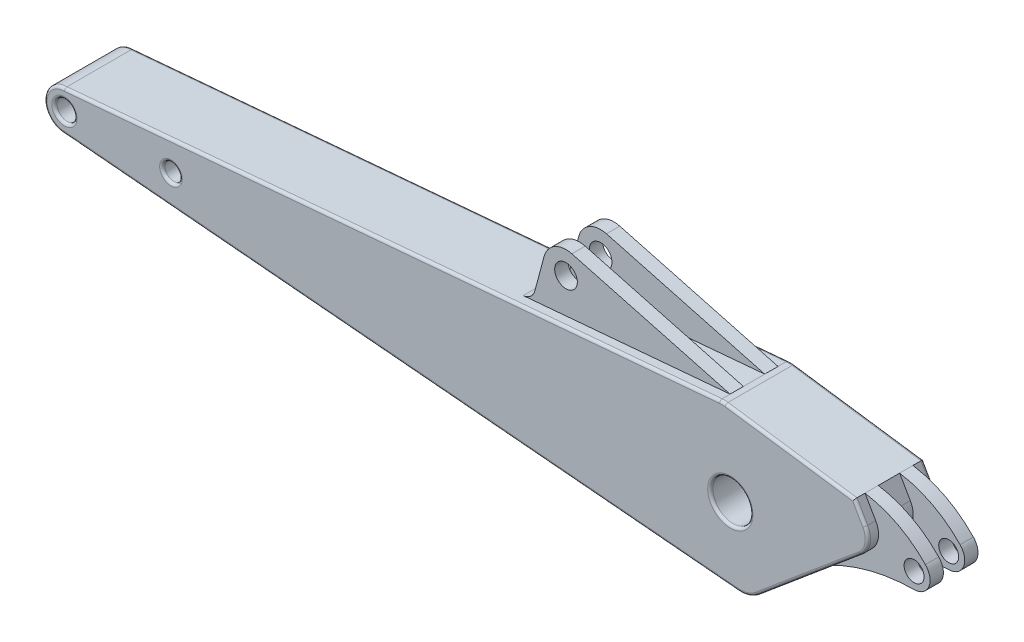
ISO-10303-21;
HEADER;
FILE_DESCRIPTION(('STEP AP214'),'2;1');
FILE_NAME('part.step','',(''),(''),'','','');
FILE_SCHEMA(('AUTOMOTIVE_DESIGN { 1 0 10303 214 1 1 1 1 }'));
ENDSEC;
DATA;
#1=APPLICATION_CONTEXT('core data for automotive mechanical design processes');
#2=APPLICATION_PROTOCOL_DEFINITION('international standard','automotive_design',2000,#1);
#3=PRODUCT_CONTEXT('',#1,'mechanical');
#4=PRODUCT('Part','Part','',(#3));
#5=PRODUCT_RELATED_PRODUCT_CATEGORY('part','',(#4));
#6=PRODUCT_DEFINITION_FORMATION('','',#4);
#7=PRODUCT_DEFINITION_CONTEXT('part definition',#1,'design');
#8=PRODUCT_DEFINITION('design','',#6,#7);
#9=PRODUCT_DEFINITION_SHAPE('','',#8);
#10=(LENGTH_UNIT() NAMED_UNIT(*) SI_UNIT(.MILLI.,.METRE.));
#11=(NAMED_UNIT(*) PLANE_ANGLE_UNIT() SI_UNIT($,.RADIAN.));
#12=(NAMED_UNIT(*) SI_UNIT($,.STERADIAN.) SOLID_ANGLE_UNIT());
#13=UNCERTAINTY_MEASURE_WITH_UNIT(LENGTH_MEASURE(1.E-05),#10,'distance_accuracy_value','');
#14=(GEOMETRIC_REPRESENTATION_CONTEXT(3) GLOBAL_UNCERTAINTY_ASSIGNED_CONTEXT((#13)) GLOBAL_UNIT_ASSIGNED_CONTEXT((#10,
#11,#12)) REPRESENTATION_CONTEXT('',''));
#15=CARTESIAN_POINT('',(0.,0.,0.));
#16=DIRECTION('',(0.,0.,1.));
#17=DIRECTION('',(1.,0.,0.));
#18=AXIS2_PLACEMENT_3D('',#15,#16,#17);
#19=CARTESIAN_POINT('',(2936.57093507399,112.007317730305,130.));
#20=DIRECTION('',(0.,0.,-1.));
#21=DIRECTION('',(-1.,0.,0.));
#22=AXIS2_PLACEMENT_3D('',#19,#20,#21);
#23=CYLINDRICAL_SURFACE('',#22,79.9999999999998);
#24=CARTESIAN_POINT('',(2936.57093507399,112.007317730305,-40.));
#25=DIRECTION('',(0.,0.,-1.));
#26=DIRECTION('',(1.,0.,0.));
#27=AXIS2_PLACEMENT_3D('',#24,#25,#26);
#28=CIRCLE('',#27,79.9999999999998);
#29=CARTESIAN_POINT('',(3005.85296737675,152.007317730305,-40.));
#30=VERTEX_POINT('',#29);
#31=CARTESIAN_POINT('',(2987.99394384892,50.7237622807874,-40.));
#32=VERTEX_POINT('',#31);
#33=EDGE_CURVE('E305',#30,#32,#28,.T.);
#34=ORIENTED_EDGE('',*,*,#33,.F.);
#35=DIRECTION('',(0.,0.,-1.));
#36=VECTOR('',#35,1.);
#37=CARTESIAN_POINT('',(3005.85296737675,152.007317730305,130.));
#38=LINE('',#37,#36);
#39=CARTESIAN_POINT('',(3005.85296737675,152.007317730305,40.));
#40=VERTEX_POINT('',#39);
#41=EDGE_CURVE('E481',#40,#30,#38,.T.);
#42=ORIENTED_EDGE('',*,*,#41,.F.);
#43=CARTESIAN_POINT('',(2936.57093507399,112.007317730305,40.));
#44=DIRECTION('',(0.,0.,-1.));
#45=DIRECTION('',(1.,0.,0.));
#46=AXIS2_PLACEMENT_3D('',#43,#44,#45);
#47=CIRCLE('',#46,79.9999999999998);
#48=CARTESIAN_POINT('',(2987.99394384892,50.7237622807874,40.));
#49=VERTEX_POINT('',#48);
#50=EDGE_CURVE('E385',#40,#49,#47,.T.);
#51=ORIENTED_EDGE('',*,*,#50,.T.);
#52=DIRECTION('',(0.,0.,-1.));
#53=VECTOR('',#52,1.);
#54=CARTESIAN_POINT('',(2987.99394384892,50.7237622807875,130.));
#55=LINE('',#54,#53);
#56=EDGE_CURVE('E485',#49,#32,#55,.T.);
#57=ORIENTED_EDGE('',*,*,#56,.T.);
#58=EDGE_LOOP('',(#34,#42,#51,#57));
#59=FACE_BOUND('',#58,.T.);
#60=ADVANCED_FACE('F32',(#59),#23,.T.);
#61=CARTESIAN_POINT('',(2965.69688563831,221.55969153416,130.));
#62=DIRECTION('',(-0.86602540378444,-0.499999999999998,0.));
#63=DIRECTION('',(0.499999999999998,-0.86602540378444,0.));
#64=AXIS2_PLACEMENT_3D('',#61,#62,#63);
#65=PLANE('',#64);
#66=DIRECTION('',(0.499999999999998,-0.86602540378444,0.));
#67=VECTOR('',#66,1.);
#68=CARTESIAN_POINT('',(3005.85296737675,152.007317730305,-40.));
#69=LINE('',#68,#67);
#70=CARTESIAN_POINT('',(2965.69688563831,221.55969153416,-40.));
#71=VERTEX_POINT('',#70);
#72=EDGE_CURVE('E762',#71,#30,#69,.T.);
#73=ORIENTED_EDGE('',*,*,#72,.F.);
#74=DIRECTION('',(0.,0.,-1.));
#75=VECTOR('',#74,1.);
#76=CARTESIAN_POINT('',(2965.69688563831,221.55969153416,130.));
#77=LINE('',#76,#75);
#78=CARTESIAN_POINT('',(2965.69688563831,221.55969153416,40.));
#79=VERTEX_POINT('',#78);
#80=EDGE_CURVE('E477',#79,#71,#77,.T.);
#81=ORIENTED_EDGE('',*,*,#80,.F.);
#82=DIRECTION('',(0.499999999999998,-0.86602540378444,0.));
#83=VECTOR('',#82,1.);
#84=CARTESIAN_POINT('',(3005.85296737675,152.007317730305,40.));
#85=LINE('',#84,#83);
#86=EDGE_CURVE('E382',#79,#40,#85,.T.);
#87=ORIENTED_EDGE('',*,*,#86,.T.);
#88=ORIENTED_EDGE('',*,*,#41,.T.);
#89=EDGE_LOOP('',(#73,#81,#87,#88));
#90=FACE_BOUND('',#89,.T.);
#91=ADVANCED_FACE('F653',(#90),#65,.F.);
#92=CARTESIAN_POINT('',(2987.99394384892,50.7237622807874,-90.));
#93=VERTEX_POINT('',#92);
#94=CARTESIAN_POINT('',(2987.99394384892,50.7237622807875,-120.));
#95=VERTEX_POINT('',#94);
#96=EDGE_CURVE('E480',#93,#95,#55,.T.);
#97=ORIENTED_EDGE('',*,*,#96,.T.);
#98=CARTESIAN_POINT('',(2936.57093507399,112.007317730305,-120.));
#99=DIRECTION('',(0.,0.,-1.));
#100=DIRECTION('',(-1.,0.,0.));
#101=AXIS2_PLACEMENT_3D('',#98,#99,#100);
#102=CIRCLE('',#101,79.9999999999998);
#103=CARTESIAN_POINT('',(3005.85296737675,152.007317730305,-120.));
#104=VERTEX_POINT('',#103);
#105=EDGE_CURVE('E534',#95,#104,#102,.F.);
#106=ORIENTED_EDGE('',*,*,#105,.T.);
#107=CARTESIAN_POINT('',(3005.85296737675,152.007317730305,-90.));
#108=VERTEX_POINT('',#107);
#109=EDGE_CURVE('E476',#108,#104,#38,.T.);
#110=ORIENTED_EDGE('',*,*,#109,.F.);
#111=CARTESIAN_POINT('',(2936.57093507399,112.007317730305,-90.));
#112=DIRECTION('',(0.,0.,-1.));
#113=DIRECTION('',(1.,0.,0.));
#114=AXIS2_PLACEMENT_3D('',#111,#112,#113);
#115=CIRCLE('',#114,79.9999999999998);
#116=EDGE_CURVE('E772',#108,#93,#115,.T.);
#117=ORIENTED_EDGE('',*,*,#116,.T.);
#118=EDGE_LOOP('',(#97,#106,#110,#117));
#119=FACE_BOUND('',#118,.T.);
#120=ADVANCED_FACE('F656',(#119),#23,.T.);
#121=ORIENTED_EDGE('',*,*,#109,.T.);
#122=DIRECTION('',(-0.499999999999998,0.86602540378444,0.));
#123=VECTOR('',#122,1.);
#124=CARTESIAN_POINT('',(2965.69688563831,221.55969153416,-120.));
#125=LINE('',#124,#123);
#126=CARTESIAN_POINT('',(2965.69688563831,221.55969153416,-120.));
#127=VERTEX_POINT('',#126);
#128=EDGE_CURVE('E536',#104,#127,#125,.T.);
#129=ORIENTED_EDGE('',*,*,#128,.T.);
#130=CARTESIAN_POINT('',(2965.69688563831,221.55969153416,-90.));
#131=VERTEX_POINT('',#130);
#132=EDGE_CURVE('E473',#131,#127,#77,.T.);
#133=ORIENTED_EDGE('',*,*,#132,.F.);
#134=DIRECTION('',(0.499999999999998,-0.86602540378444,0.));
#135=VECTOR('',#134,1.);
#136=CARTESIAN_POINT('',(3005.85296737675,152.007317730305,-90.));
#137=LINE('',#136,#135);
#138=EDGE_CURVE('E775',#131,#108,#137,.T.);
#139=ORIENTED_EDGE('',*,*,#138,.T.);
#140=EDGE_LOOP('',(#121,#129,#133,#139));
#141=FACE_BOUND('',#140,.T.);
#142=ADVANCED_FACE('F663',(#141),#65,.F.);
#143=CARTESIAN_POINT('',(0.,0.,130.));
#144=DIRECTION('',(0.,0.,-1.));
#145=DIRECTION('',(-1.,0.,0.));
#146=AXIS2_PLACEMENT_3D('',#143,#144,#145);
#147=CYLINDRICAL_SURFACE('',#146,75.);
#148=DIRECTION('',(0.,0.,-1.));
#149=VECTOR('',#148,1.);
#150=CARTESIAN_POINT('',(0.,75.,130.));
#151=LINE('',#150,#149);
#152=CARTESIAN_POINT('',(0.,75.,120.));
#153=VERTEX_POINT('',#152);
#154=CARTESIAN_POINT('',(0.,75.,-120.));
#155=VERTEX_POINT('',#154);
#156=EDGE_CURVE('E463',#153,#155,#151,.T.);
#157=ORIENTED_EDGE('',*,*,#156,.T.);
#158=CARTESIAN_POINT('',(0.,0.,-120.));
#159=DIRECTION('',(0.,0.,-1.));
#160=DIRECTION('',(-1.,0.,0.));
#161=AXIS2_PLACEMENT_3D('',#158,#159,#160);
#162=CIRCLE('',#161,75.);
#163=CARTESIAN_POINT('',(0.,-75.,-120.));
#164=VERTEX_POINT('',#163);
#165=EDGE_CURVE('E553',#155,#164,#162,.F.);
#166=ORIENTED_EDGE('',*,*,#165,.T.);
#167=DIRECTION('',(0.,0.,-1.));
#168=VECTOR('',#167,1.);
#169=CARTESIAN_POINT('',(0.,-75.,130.));
#170=LINE('',#169,#168);
#171=CARTESIAN_POINT('',(0.,-75.,120.));
#172=VERTEX_POINT('',#171);
#173=EDGE_CURVE('E490',#172,#164,#170,.T.);
#174=ORIENTED_EDGE('',*,*,#173,.F.);
#175=CARTESIAN_POINT('',(0.,0.,120.));
#176=DIRECTION('',(0.,0.,-1.));
#177=DIRECTION('',(-1.,0.,0.));
#178=AXIS2_PLACEMENT_3D('',#175,#176,#177);
#179=CIRCLE('',#178,75.);
#180=EDGE_CURVE('E551',#172,#153,#179,.T.);
#181=ORIENTED_EDGE('',*,*,#180,.T.);
#182=EDGE_LOOP('',(#157,#166,#174,#181));
#183=FACE_BOUND('',#182,.T.);
#184=ADVANCED_FACE('F34',(#183),#147,.T.);
#185=CARTESIAN_POINT('',(0.,-75.,130.));
#186=DIRECTION('',(0.0871557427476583,0.996194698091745,0.));
#187=DIRECTION('',(-0.996194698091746,0.0871557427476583,0.));
#188=AXIS2_PLACEMENT_3D('',#185,#186,#187);
#189=PLANE('',#188);
#190=ORIENTED_EDGE('',*,*,#173,.T.);
#191=DIRECTION('',(0.996194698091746,-0.0871557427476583,0.));
#192=VECTOR('',#191,1.);
#193=CARTESIAN_POINT('',(2528.91858560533,-296.25170722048,-120.));
#194=LINE('',#193,#192);
#195=CARTESIAN_POINT('',(2528.91858560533,-296.25170722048,-120.));
#196=VERTEX_POINT('',#195);
#197=EDGE_CURVE('E495',#164,#196,#194,.T.);
#198=ORIENTED_EDGE('',*,*,#197,.T.);
#199=DIRECTION('',(0.,0.,-1.));
#200=VECTOR('',#199,1.);
#201=CARTESIAN_POINT('',(2528.91858560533,-296.25170722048,130.));
#202=LINE('',#201,#200);
#203=CARTESIAN_POINT('',(2528.91858560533,-296.25170722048,120.));
#204=VERTEX_POINT('',#203);
#205=EDGE_CURVE('E487',#204,#196,#202,.T.);
#206=ORIENTED_EDGE('',*,*,#205,.F.);
#207=DIRECTION('',(0.996194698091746,-0.0871557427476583,0.));
#208=VECTOR('',#207,1.);
#209=CARTESIAN_POINT('',(0.,-75.,120.));
#210=LINE('',#209,#208);
#211=EDGE_CURVE('E493',#204,#172,#210,.F.);
#212=ORIENTED_EDGE('',*,*,#211,.T.);
#213=EDGE_LOOP('',(#190,#198,#206,#212));
#214=FACE_BOUND('',#213,.T.);
#215=ADVANCED_FACE('F1155',(#214),#189,.F.);
#216=CARTESIAN_POINT('',(2537.63415988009,-196.632237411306,130.));
#217=DIRECTION('',(0.,0.,-1.));
#218=DIRECTION('',(-1.,0.,0.));
#219=AXIS2_PLACEMENT_3D('',#216,#217,#218);
#220=CYLINDRICAL_SURFACE('',#219,99.9999999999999);
#221=ORIENTED_EDGE('',*,*,#205,.T.);
#222=CARTESIAN_POINT('',(2537.63415988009,-196.632237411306,-120.));
#223=DIRECTION('',(0.,0.,-1.));
#224=DIRECTION('',(-1.,0.,0.));
#225=AXIS2_PLACEMENT_3D('',#222,#223,#224);
#226=CIRCLE('',#225,99.9999999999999);
#227=CARTESIAN_POINT('',(2601.91292084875,-273.236681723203,-120.));
#228=VERTEX_POINT('',#227);
#229=EDGE_CURVE('E528',#196,#228,#226,.F.);
#230=ORIENTED_EDGE('',*,*,#229,.T.);
#231=DIRECTION('',(0.,0.,-1.));
#232=VECTOR('',#231,1.);
#233=CARTESIAN_POINT('',(2601.91292084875,-273.236681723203,130.));
#234=LINE('',#233,#232);
#235=CARTESIAN_POINT('',(2601.91292084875,-273.236681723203,120.));
#236=VERTEX_POINT('',#235);
#237=EDGE_CURVE('E484',#236,#228,#234,.T.);
#238=ORIENTED_EDGE('',*,*,#237,.F.);
#239=CARTESIAN_POINT('',(2537.63415988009,-196.632237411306,120.));
#240=DIRECTION('',(0.,0.,-1.));
#241=DIRECTION('',(-1.,0.,0.));
#242=AXIS2_PLACEMENT_3D('',#239,#240,#241);
#243=CIRCLE('',#242,99.9999999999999);
#244=EDGE_CURVE('E526',#236,#204,#243,.T.);
#245=ORIENTED_EDGE('',*,*,#244,.T.);
#246=EDGE_LOOP('',(#221,#230,#238,#245));
#247=FACE_BOUND('',#246,.T.);
#248=ADVANCED_FACE('F675',(#247),#220,.T.);
#249=CARTESIAN_POINT('',(2601.91292084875,-273.236681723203,130.));
#250=DIRECTION('',(-0.642787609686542,0.766044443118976,0.));
#251=DIRECTION('',(-0.766044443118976,-0.642787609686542,0.));
#252=AXIS2_PLACEMENT_3D('',#249,#250,#251);
#253=PLANE('',#252);
#254=ORIENTED_EDGE('',*,*,#237,.T.);
#255=DIRECTION('',(0.766044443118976,0.642787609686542,0.));
#256=VECTOR('',#255,1.);
#257=CARTESIAN_POINT('',(2987.99394384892,50.7237622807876,-120.));
#258=LINE('',#257,#256);
#259=EDGE_CURVE('E532',#228,#95,#258,.T.);
#260=ORIENTED_EDGE('',*,*,#259,.T.);
#261=ORIENTED_EDGE('',*,*,#96,.F.);
#262=DIRECTION('',(-0.766044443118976,-0.642787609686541,0.));
#263=VECTOR('',#262,1.);
#264=CARTESIAN_POINT('',(2832.20343051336,-80.,-90.));
#265=LINE('',#264,#263);
#266=CARTESIAN_POINT('',(2832.20343051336,-80.,-90.));
#267=VERTEX_POINT('',#266);
#268=EDGE_CURVE('E314',#93,#267,#265,.T.);
#269=ORIENTED_EDGE('',*,*,#268,.T.);
#270=DIRECTION('',(0.,0.,1.));
#271=VECTOR('',#270,1.);
#272=CARTESIAN_POINT('',(2832.20343051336,-80.,-90.));
#273=LINE('',#272,#271);
#274=CARTESIAN_POINT('',(2832.20343051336,-80.,-40.));
#275=VERTEX_POINT('',#274);
#276=EDGE_CURVE('E293',#267,#275,#273,.T.);
#277=ORIENTED_EDGE('',*,*,#276,.T.);
#278=DIRECTION('',(-0.766044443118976,-0.642787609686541,0.));
#279=VECTOR('',#278,1.);
#280=CARTESIAN_POINT('',(2832.20343051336,-80.,-40.));
#281=LINE('',#280,#279);
#282=EDGE_CURVE('E299',#32,#275,#281,.T.);
#283=ORIENTED_EDGE('',*,*,#282,.F.);
#284=ORIENTED_EDGE('',*,*,#56,.F.);
#285=DIRECTION('',(-0.766044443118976,-0.642787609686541,0.));
#286=VECTOR('',#285,1.);
#287=CARTESIAN_POINT('',(2832.20343051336,-80.,40.));
#288=LINE('',#287,#286);
#289=CARTESIAN_POINT('',(2832.20343051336,-80.,40.));
#290=VERTEX_POINT('',#289);
#291=EDGE_CURVE('E388',#49,#290,#288,.T.);
#292=ORIENTED_EDGE('',*,*,#291,.T.);
#293=DIRECTION('',(0.,0.,-1.));
#294=VECTOR('',#293,1.);
#295=CARTESIAN_POINT('',(2832.20343051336,-80.,90.));
#296=LINE('',#295,#294);
#297=CARTESIAN_POINT('',(2832.20343051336,-80.,90.));
#298=VERTEX_POINT('',#297);
#299=EDGE_CURVE('E407',#298,#290,#296,.T.);
#300=ORIENTED_EDGE('',*,*,#299,.F.);
#301=DIRECTION('',(-0.766044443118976,-0.642787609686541,0.));
#302=VECTOR('',#301,1.);
#303=CARTESIAN_POINT('',(2832.20343051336,-80.,90.));
#304=LINE('',#303,#302);
#305=CARTESIAN_POINT('',(2987.99394384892,50.7237622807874,90.));
#306=VERTEX_POINT('',#305);
#307=EDGE_CURVE('E405',#306,#298,#304,.T.);
#308=ORIENTED_EDGE('',*,*,#307,.F.);
#309=CARTESIAN_POINT('',(2987.99394384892,50.7237622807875,120.));
#310=VERTEX_POINT('',#309);
#311=EDGE_CURVE('E482',#310,#306,#55,.T.);
#312=ORIENTED_EDGE('',*,*,#311,.F.);
#313=DIRECTION('',(0.766044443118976,0.642787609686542,0.));
#314=VECTOR('',#313,1.);
#315=CARTESIAN_POINT('',(2601.91292084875,-273.236681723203,120.));
#316=LINE('',#315,#314);
#317=EDGE_CURVE('E530',#310,#236,#316,.F.);
#318=ORIENTED_EDGE('',*,*,#317,.T.);
#319=EDGE_LOOP('',(#254,#260,#261,#269,#277,#283,#284,#292,#300,#308,#312,#318));
#320=FACE_BOUND('',#319,.T.);
#321=ADVANCED_FACE('F312',(#320),#253,.F.);
#322=CARTESIAN_POINT('',(3005.85296737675,152.007317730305,120.));
#323=VERTEX_POINT('',#322);
#324=CARTESIAN_POINT('',(3005.85296737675,152.007317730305,90.));
#325=VERTEX_POINT('',#324);
#326=EDGE_CURVE('E478',#323,#325,#38,.T.);
#327=ORIENTED_EDGE('',*,*,#326,.F.);
#328=CARTESIAN_POINT('',(2936.57093507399,112.007317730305,120.));
#329=DIRECTION('',(0.,0.,-1.));
#330=DIRECTION('',(-1.,0.,0.));
#331=AXIS2_PLACEMENT_3D('',#328,#329,#330);
#332=CIRCLE('',#331,79.9999999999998);
#333=EDGE_CURVE('E11',#323,#310,#332,.T.);
#334=ORIENTED_EDGE('',*,*,#333,.T.);
#335=ORIENTED_EDGE('',*,*,#311,.T.);
#336=CARTESIAN_POINT('',(2936.57093507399,112.007317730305,90.));
#337=DIRECTION('',(0.,0.,-1.));
#338=DIRECTION('',(1.,0.,0.));
#339=AXIS2_PLACEMENT_3D('',#336,#337,#338);
#340=CIRCLE('',#339,79.9999999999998);
#341=EDGE_CURVE('E402',#325,#306,#340,.T.);
#342=ORIENTED_EDGE('',*,*,#341,.F.);
#343=EDGE_LOOP('',(#327,#334,#335,#342));
#344=FACE_BOUND('',#343,.T.);
#345=ADVANCED_FACE('F657',(#344),#23,.T.);
#346=CARTESIAN_POINT('',(2965.69688563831,221.55969153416,120.));
#347=VERTEX_POINT('',#346);
#348=CARTESIAN_POINT('',(2965.69688563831,221.55969153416,90.));
#349=VERTEX_POINT('',#348);
#350=EDGE_CURVE('E474',#347,#349,#77,.T.);
#351=ORIENTED_EDGE('',*,*,#350,.F.);
#352=DIRECTION('',(-0.499999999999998,0.86602540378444,0.));
#353=VECTOR('',#352,1.);
#354=CARTESIAN_POINT('',(2965.69688563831,221.55969153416,120.));
#355=LINE('',#354,#353);
#356=EDGE_CURVE('E40',#347,#323,#355,.F.);
#357=ORIENTED_EDGE('',*,*,#356,.T.);
#358=ORIENTED_EDGE('',*,*,#326,.T.);
#359=DIRECTION('',(0.499999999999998,-0.86602540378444,0.));
#360=VECTOR('',#359,1.);
#361=CARTESIAN_POINT('',(3005.85296737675,152.007317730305,90.));
#362=LINE('',#361,#360);
#363=EDGE_CURVE('E399',#349,#325,#362,.T.);
#364=ORIENTED_EDGE('',*,*,#363,.F.);
#365=EDGE_LOOP('',(#351,#357,#358,#364));
#366=FACE_BOUND('',#365,.T.);
#367=ADVANCED_FACE('F664',(#366),#65,.F.);
#368=CARTESIAN_POINT('',(2481.84553074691,289.560564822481,130.));
#369=DIRECTION('',(-0.139173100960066,-0.99026806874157,0.));
#370=DIRECTION('',(0.99026806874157,-0.139173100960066,0.));
#371=AXIS2_PLACEMENT_3D('',#368,#369,#370);
#372=PLANE('',#371);
#373=ORIENTED_EDGE('',*,*,#132,.T.);
#374=DIRECTION('',(-0.99026806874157,0.139173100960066,0.));
#375=VECTOR('',#374,1.);
#376=CARTESIAN_POINT('',(2481.84553074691,289.560564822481,-120.));
#377=LINE('',#376,#375);
#378=CARTESIAN_POINT('',(2481.84553074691,289.560564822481,-120.));
#379=VERTEX_POINT('',#378);
#380=EDGE_CURVE('E540',#127,#379,#377,.T.);
#381=ORIENTED_EDGE('',*,*,#380,.T.);
#382=DIRECTION('',(0.,0.,-1.));
#383=VECTOR('',#382,1.);
#384=CARTESIAN_POINT('',(2481.84553074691,289.560564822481,130.));
#385=LINE('',#384,#383);
#386=CARTESIAN_POINT('',(2481.84553074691,289.560564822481,120.));
#387=VERTEX_POINT('',#386);
#388=EDGE_CURVE('E469',#387,#379,#385,.T.);
#389=ORIENTED_EDGE('',*,*,#388,.F.);
#390=DIRECTION('',(-0.99026806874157,0.139173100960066,0.));
#391=VECTOR('',#390,1.);
#392=CARTESIAN_POINT('',(2481.84553074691,289.560564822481,120.));
#393=LINE('',#392,#391);
#394=EDGE_CURVE('E538',#387,#347,#393,.F.);
#395=ORIENTED_EDGE('',*,*,#394,.T.);
#396=ORIENTED_EDGE('',*,*,#350,.T.);
#397=DIRECTION('',(0.,0.,-1.));
#398=VECTOR('',#397,1.);
#399=CARTESIAN_POINT('',(2965.69688563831,221.55969153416,90.));
#400=LINE('',#399,#398);
#401=EDGE_CURVE('E409',#349,#79,#400,.T.);
#402=ORIENTED_EDGE('',*,*,#401,.T.);
#403=ORIENTED_EDGE('',*,*,#80,.T.);
#404=DIRECTION('',(0.,0.,1.));
#405=VECTOR('',#404,1.);
#406=CARTESIAN_POINT('',(2965.69688563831,221.55969153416,-90.));
#407=LINE('',#406,#405);
#408=EDGE_CURVE('E316',#131,#71,#407,.T.);
#409=ORIENTED_EDGE('',*,*,#408,.F.);
#410=EDGE_LOOP('',(#373,#381,#389,#395,#396,#402,#403,#409));
#411=FACE_BOUND('',#410,.T.);
#412=ADVANCED_FACE('F674',(#411),#372,.F.);
#413=CARTESIAN_POINT('',(2467.9282206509,190.533757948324,130.));
#414=DIRECTION('',(0.,0.,-1.));
#415=DIRECTION('',(-1.,0.,0.));
#416=AXIS2_PLACEMENT_3D('',#413,#414,#415);
#417=CYLINDRICAL_SURFACE('',#416,100.);
#418=ORIENTED_EDGE('',*,*,#388,.T.);
#419=CARTESIAN_POINT('',(2467.9282206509,190.533757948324,-120.));
#420=DIRECTION('',(0.,0.,-1.));
#421=DIRECTION('',(-1.,0.,0.));
#422=AXIS2_PLACEMENT_3D('',#419,#420,#421);
#423=CIRCLE('',#422,100.);
#424=CARTESIAN_POINT('',(2459.21264637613,290.153227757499,-120.));
#425=VERTEX_POINT('',#424);
#426=EDGE_CURVE('E544',#379,#425,#423,.F.);
#427=ORIENTED_EDGE('',*,*,#426,.T.);
#428=DIRECTION('',(0.,0.,-1.));
#429=VECTOR('',#428,1.);
#430=CARTESIAN_POINT('',(2459.21264637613,290.153227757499,130.));
#431=LINE('',#430,#429);
#432=CARTESIAN_POINT('',(2459.21264637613,290.153227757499,-90.));
#433=VERTEX_POINT('',#432);
#434=EDGE_CURVE('E466',#433,#425,#431,.T.);
#435=ORIENTED_EDGE('',*,*,#434,.F.);
#436=DIRECTION('',(0.,0.,1.));
#437=VECTOR('',#436,1.);
#438=CARTESIAN_POINT('',(2459.21264637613,290.153227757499,-90.));
#439=LINE('',#438,#437);
#440=CARTESIAN_POINT('',(2459.21264637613,290.153227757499,-40.));
#441=VERTEX_POINT('',#440);
#442=EDGE_CURVE('E365',#433,#441,#439,.T.);
#443=ORIENTED_EDGE('',*,*,#442,.T.);
#444=CARTESIAN_POINT('',(2459.21264637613,290.153227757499,40.));
#445=VERTEX_POINT('',#444);
#446=EDGE_CURVE('E470',#445,#441,#431,.T.);
#447=ORIENTED_EDGE('',*,*,#446,.F.);
#448=DIRECTION('',(0.,0.,-1.));
#449=VECTOR('',#448,1.);
#450=CARTESIAN_POINT('',(2459.21264637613,290.153227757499,90.));
#451=LINE('',#450,#449);
#452=CARTESIAN_POINT('',(2459.21264637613,290.153227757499,90.));
#453=VERTEX_POINT('',#452);
#454=EDGE_CURVE('E449',#453,#445,#451,.T.);
#455=ORIENTED_EDGE('',*,*,#454,.F.);
#456=CARTESIAN_POINT('',(2459.21264637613,290.153227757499,120.));
#457=VERTEX_POINT('',#456);
#458=EDGE_CURVE('E467',#457,#453,#431,.T.);
#459=ORIENTED_EDGE('',*,*,#458,.F.);
#460=CARTESIAN_POINT('',(2467.9282206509,190.533757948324,120.));
#461=DIRECTION('',(0.,0.,-1.));
#462=DIRECTION('',(-1.,0.,0.));
#463=AXIS2_PLACEMENT_3D('',#460,#461,#462);
#464=CIRCLE('',#463,100.);
#465=EDGE_CURVE('E542',#457,#387,#464,.T.);
#466=ORIENTED_EDGE('',*,*,#465,.T.);
#467=EDGE_LOOP('',(#418,#427,#435,#443,#447,#455,#459,#466));
#468=FACE_BOUND('',#467,.T.);
#469=ADVANCED_FACE('F827',(#468),#417,.T.);
#470=CARTESIAN_POINT('',(0.,75.,130.));
#471=DIRECTION('',(0.0871557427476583,-0.996194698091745,0.));
#472=DIRECTION('',(0.996194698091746,0.0871557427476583,0.));
#473=AXIS2_PLACEMENT_3D('',#470,#471,#472);
#474=PLANE('',#473);
#475=ORIENTED_EDGE('',*,*,#434,.T.);
#476=DIRECTION('',(-0.996194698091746,-0.0871557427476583,0.));
#477=VECTOR('',#476,1.);
#478=CARTESIAN_POINT('',(0.,75.,-120.));
#479=LINE('',#478,#477);
#480=EDGE_CURVE('E549',#425,#155,#479,.T.);
#481=ORIENTED_EDGE('',*,*,#480,.T.);
#482=ORIENTED_EDGE('',*,*,#156,.F.);
#483=DIRECTION('',(-0.996194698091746,-0.0871557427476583,0.));
#484=VECTOR('',#483,1.);
#485=CARTESIAN_POINT('',(0.,75.,120.));
#486=LINE('',#485,#484);
#487=EDGE_CURVE('E546',#153,#457,#486,.F.);
#488=ORIENTED_EDGE('',*,*,#487,.T.);
#489=ORIENTED_EDGE('',*,*,#458,.T.);
#490=DIRECTION('',(0.996194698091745,0.0871557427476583,0.));
#491=VECTOR('',#490,1.);
#492=CARTESIAN_POINT('',(2459.21264637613,290.153227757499,90.));
#493=LINE('',#492,#491);
#494=CARTESIAN_POINT('',(1682.2457161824,222.17742943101,90.));
#495=VERTEX_POINT('',#494);
#496=EDGE_CURVE('E446',#495,#453,#493,.T.);
#497=ORIENTED_EDGE('',*,*,#496,.F.);
#498=DIRECTION('',(0.,0.,-1.));
#499=VECTOR('',#498,1.);
#500=CARTESIAN_POINT('',(1682.2457161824,222.17742943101,90.));
#501=LINE('',#500,#499);
#502=CARTESIAN_POINT('',(1682.2457161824,222.17742943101,40.));
#503=VERTEX_POINT('',#502);
#504=EDGE_CURVE('E451',#495,#503,#501,.T.);
#505=ORIENTED_EDGE('',*,*,#504,.T.);
#506=DIRECTION('',(0.996194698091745,0.0871557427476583,0.));
#507=VECTOR('',#506,1.);
#508=CARTESIAN_POINT('',(2459.21264637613,290.153227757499,40.));
#509=LINE('',#508,#507);
#510=EDGE_CURVE('E434',#503,#445,#509,.T.);
#511=ORIENTED_EDGE('',*,*,#510,.T.);
#512=ORIENTED_EDGE('',*,*,#446,.T.);
#513=DIRECTION('',(0.996194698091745,0.0871557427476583,0.));
#514=VECTOR('',#513,1.);
#515=CARTESIAN_POINT('',(2459.21264637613,290.153227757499,-40.));
#516=LINE('',#515,#514);
#517=CARTESIAN_POINT('',(1682.2457161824,222.17742943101,-40.));
#518=VERTEX_POINT('',#517);
#519=EDGE_CURVE('E330',#518,#441,#516,.T.);
#520=ORIENTED_EDGE('',*,*,#519,.F.);
#521=DIRECTION('',(0.,0.,1.));
#522=VECTOR('',#521,1.);
#523=CARTESIAN_POINT('',(1682.2457161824,222.17742943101,-90.));
#524=LINE('',#523,#522);
#525=CARTESIAN_POINT('',(1682.2457161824,222.17742943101,-90.));
#526=VERTEX_POINT('',#525);
#527=EDGE_CURVE('E362',#526,#518,#524,.T.);
#528=ORIENTED_EDGE('',*,*,#527,.F.);
#529=DIRECTION('',(0.996194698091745,0.0871557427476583,0.));
#530=VECTOR('',#529,1.);
#531=CARTESIAN_POINT('',(2459.21264637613,290.153227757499,-90.));
#532=LINE('',#531,#530);
#533=EDGE_CURVE('E345',#526,#433,#532,.T.);
#534=ORIENTED_EDGE('',*,*,#533,.T.);
#535=EDGE_LOOP('',(#475,#481,#482,#488,#489,#497,#505,#511,#512,#520,#528,#534));
#536=FACE_BOUND('',#535,.T.);
#537=ADVANCED_FACE('F830',(#536),#474,.F.);
#538=CARTESIAN_POINT('',(0.,0.,130.));
#539=DIRECTION('',(0.,0.,-1.));
#540=DIRECTION('',(-1.,0.,0.));
#541=AXIS2_PLACEMENT_3D('',#538,#539,#540);
#542=PLANE('',#541);
#543=CARTESIAN_POINT('',(2467.9282206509,190.533757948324,130.));
#544=DIRECTION('',(0.,0.,-1.));
#545=DIRECTION('',(-1.,0.,0.));
#546=AXIS2_PLACEMENT_3D('',#543,#544,#545);
#547=CIRCLE('',#546,90.);
#548=CARTESIAN_POINT('',(2480.45379973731,279.657884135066,130.));
#549=VERTEX_POINT('',#548);
#550=CARTESIAN_POINT('',(2460.08420380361,280.191280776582,130.));
#551=VERTEX_POINT('',#550);
#552=EDGE_CURVE('E54',#549,#551,#547,.F.);
#553=ORIENTED_EDGE('',*,*,#552,.T.);
#554=DIRECTION('',(-0.996194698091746,-0.0871557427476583,0.));
#555=VECTOR('',#554,1.);
#556=CARTESIAN_POINT('',(-5.64024923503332,64.4683437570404,130.));
#557=LINE('',#556,#555);
#558=CARTESIAN_POINT('',(0.421023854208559,64.9986364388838,130.));
#559=VERTEX_POINT('',#558);
#560=EDGE_CURVE('E597',#551,#559,#557,.T.);
#561=ORIENTED_EDGE('',*,*,#560,.T.);
#562=CARTESIAN_POINT('',(0.,0.,130.));
#563=DIRECTION('',(0.,0.,-1.));
#564=DIRECTION('',(-1.,0.,0.));
#565=AXIS2_PLACEMENT_3D('',#562,#563,#564);
#566=CIRCLE('',#565,65.);
#567=CARTESIAN_POINT('',(0.421023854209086,-64.9986364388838,130.));
#568=VERTEX_POINT('',#567);
#569=EDGE_CURVE('E582',#559,#568,#566,.F.);
#570=ORIENTED_EDGE('',*,*,#569,.T.);
#571=DIRECTION('',(0.996194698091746,-0.0871557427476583,0.));
#572=VECTOR('',#571,1.);
#573=CARTESIAN_POINT('',(-5.64024923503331,-64.4683437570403,130.));
#574=LINE('',#573,#572);
#575=CARTESIAN_POINT('',(2529.7901430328,-286.289760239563,130.));
#576=VERTEX_POINT('',#575);
#577=EDGE_CURVE('E584',#568,#576,#574,.T.);
#578=ORIENTED_EDGE('',*,*,#577,.T.);
#579=CARTESIAN_POINT('',(2537.63415988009,-196.632237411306,130.));
#580=DIRECTION('',(0.,0.,-1.));
#581=DIRECTION('',(-1.,0.,0.));
#582=AXIS2_PLACEMENT_3D('',#579,#580,#581);
#583=CIRCLE('',#582,89.9999999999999);
#584=CARTESIAN_POINT('',(2595.48504475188,-265.576237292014,130.));
#585=VERTEX_POINT('',#584);
#586=EDGE_CURVE('E586',#576,#585,#583,.F.);
#587=ORIENTED_EDGE('',*,*,#586,.T.);
#588=DIRECTION('',(0.766044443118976,0.642787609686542,0.));
#589=VECTOR('',#588,1.);
#590=CARTESIAN_POINT('',(1203.16266703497,-1433.87343091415,130.));
#591=LINE('',#590,#589);
#592=CARTESIAN_POINT('',(2981.56606775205,58.3842067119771,130.));
#593=VERTEX_POINT('',#592);
#594=EDGE_CURVE('E588',#585,#593,#591,.T.);
#595=ORIENTED_EDGE('',*,*,#594,.T.);
#596=CARTESIAN_POINT('',(2936.57093507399,112.007317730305,130.));
#597=DIRECTION('',(0.,0.,-1.));
#598=DIRECTION('',(-1.,0.,0.));
#599=AXIS2_PLACEMENT_3D('',#596,#597,#598);
#600=CIRCLE('',#599,69.9999999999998);
#601=CARTESIAN_POINT('',(2997.1927133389,147.007317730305,130.));
#602=VERTEX_POINT('',#601);
#603=EDGE_CURVE('E590',#593,#602,#600,.F.);
#604=ORIENTED_EDGE('',*,*,#603,.T.);
#605=DIRECTION('',(-0.499999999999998,0.86602540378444,0.));
#606=VECTOR('',#605,1.);
#607=CARTESIAN_POINT('',(2311.55057085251,1334.57434432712,130.));
#608=LINE('',#607,#606);
#609=CARTESIAN_POINT('',(2959.4752945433,212.335803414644,130.));
#610=VERTEX_POINT('',#609);
#611=EDGE_CURVE('E592',#602,#610,#608,.T.);
#612=ORIENTED_EDGE('',*,*,#611,.T.);
#613=DIRECTION('',(-0.99026806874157,0.139173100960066,0.));
#614=VECTOR('',#613,1.);
#615=CARTESIAN_POINT('',(86.5863666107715,616.094011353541,130.));
#616=LINE('',#615,#614);
#617=EDGE_CURVE('E594',#610,#549,#616,.T.);
#618=ORIENTED_EDGE('',*,*,#617,.T.);
#619=EDGE_LOOP('',(#553,#561,#570,#578,#587,#595,#604,#612,#618));
#620=FACE_BOUND('',#619,.T.);
#621=CARTESIAN_POINT('',(400.,0.,130.));
#622=DIRECTION('',(0.,0.,-1.));
#623=DIRECTION('',(-1.,0.,0.));
#624=AXIS2_PLACEMENT_3D('',#621,#622,#623);
#625=CIRCLE('',#624,42.5);
#626=CARTESIAN_POINT('',(357.5,0.,130.));
#627=VERTEX_POINT('',#626);
#628=EDGE_CURVE('E579',#627,#627,#625,.T.);
#629=ORIENTED_EDGE('',*,*,#628,.T.);
#630=EDGE_LOOP('',(#629));
#631=FACE_BOUND('',#630,.T.);
#632=CARTESIAN_POINT('',(0.,0.,130.));
#633=DIRECTION('',(0.,0.,-1.));
#634=DIRECTION('',(-1.,0.,0.));
#635=AXIS2_PLACEMENT_3D('',#632,#633,#634);
#636=CIRCLE('',#635,47.5);
#637=CARTESIAN_POINT('',(-47.5,0.,130.));
#638=VERTEX_POINT('',#637);
#639=EDGE_CURVE('E576',#638,#638,#636,.T.);
#640=ORIENTED_EDGE('',*,*,#639,.T.);
#641=EDGE_LOOP('',(#640));
#642=FACE_BOUND('',#641,.T.);
#643=CARTESIAN_POINT('',(2500.,-20.,130.));
#644=DIRECTION('',(0.,0.,-1.));
#645=DIRECTION('',(-1.,0.,0.));
#646=AXIS2_PLACEMENT_3D('',#643,#644,#645);
#647=CIRCLE('',#646,85.);
#648=CARTESIAN_POINT('',(2415.,-20.,130.));
#649=VERTEX_POINT('',#648);
#650=EDGE_CURVE('E573',#649,#649,#647,.T.);
#651=ORIENTED_EDGE('',*,*,#650,.T.);
#652=EDGE_LOOP('',(#651));
#653=FACE_BOUND('',#652,.T.);
#654=ADVANCED_FACE('F599',(#620,#631,#642,#653),#542,.F.);
#655=CARTESIAN_POINT('',(0.,0.,-130.));
#656=DIRECTION('',(0.,0.,-1.));
#657=DIRECTION('',(-1.,0.,0.));
#658=AXIS2_PLACEMENT_3D('',#655,#656,#657);
#659=PLANE('',#658);
#660=CARTESIAN_POINT('',(2537.63415988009,-196.632237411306,-130.));
#661=DIRECTION('',(0.,0.,-1.));
#662=DIRECTION('',(-1.,0.,0.));
#663=AXIS2_PLACEMENT_3D('',#660,#661,#662);
#664=CIRCLE('',#663,89.9999999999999);
#665=CARTESIAN_POINT('',(2595.48504475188,-265.576237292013,-130.));
#666=VERTEX_POINT('',#665);
#667=CARTESIAN_POINT('',(2529.7901430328,-286.289760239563,-130.));
#668=VERTEX_POINT('',#667);
#669=EDGE_CURVE('E521',#666,#668,#664,.T.);
#670=ORIENTED_EDGE('',*,*,#669,.T.);
#671=DIRECTION('',(0.996194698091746,-0.0871557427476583,0.));
#672=VECTOR('',#671,1.);
#673=CARTESIAN_POINT('',(0.871557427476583,-65.0380530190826,-130.));
#674=LINE('',#673,#672);
#675=CARTESIAN_POINT('',(0.421023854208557,-64.9986364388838,-130.));
#676=VERTEX_POINT('',#675);
#677=EDGE_CURVE('E523',#668,#676,#674,.F.);
#678=ORIENTED_EDGE('',*,*,#677,.T.);
#679=CARTESIAN_POINT('',(0.,0.,-130.));
#680=DIRECTION('',(0.,0.,-1.));
#681=DIRECTION('',(-1.,0.,0.));
#682=AXIS2_PLACEMENT_3D('',#679,#680,#681);
#683=CIRCLE('',#682,65.);
#684=CARTESIAN_POINT('',(0.421023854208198,64.9986364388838,-130.));
#685=VERTEX_POINT('',#684);
#686=EDGE_CURVE('E507',#676,#685,#683,.T.);
#687=ORIENTED_EDGE('',*,*,#686,.T.);
#688=DIRECTION('',(-0.996194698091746,-0.0871557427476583,0.));
#689=VECTOR('',#688,1.);
#690=CARTESIAN_POINT('',(2460.08420380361,280.191280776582,-130.));
#691=LINE('',#690,#689);
#692=CARTESIAN_POINT('',(2460.08420380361,280.191280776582,-130.));
#693=VERTEX_POINT('',#692);
#694=EDGE_CURVE('E509',#685,#693,#691,.F.);
#695=ORIENTED_EDGE('',*,*,#694,.T.);
#696=CARTESIAN_POINT('',(2467.9282206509,190.533757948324,-130.));
#697=DIRECTION('',(0.,0.,-1.));
#698=DIRECTION('',(-1.,0.,0.));
#699=AXIS2_PLACEMENT_3D('',#696,#697,#698);
#700=CIRCLE('',#699,90.);
#701=CARTESIAN_POINT('',(2480.45379973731,279.657884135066,-130.));
#702=VERTEX_POINT('',#701);
#703=EDGE_CURVE('E511',#693,#702,#700,.T.);
#704=ORIENTED_EDGE('',*,*,#703,.T.);
#705=DIRECTION('',(-0.99026806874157,0.139173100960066,0.));
#706=VECTOR('',#705,1.);
#707=CARTESIAN_POINT('',(2964.30515462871,211.657010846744,-130.));
#708=LINE('',#707,#706);
#709=CARTESIAN_POINT('',(2959.4752945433,212.335803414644,-130.));
#710=VERTEX_POINT('',#709);
#711=EDGE_CURVE('E513',#702,#710,#708,.F.);
#712=ORIENTED_EDGE('',*,*,#711,.T.);
#713=DIRECTION('',(-0.499999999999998,0.86602540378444,0.));
#714=VECTOR('',#713,1.);
#715=CARTESIAN_POINT('',(2997.1927133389,147.007317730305,-130.));
#716=LINE('',#715,#714);
#717=CARTESIAN_POINT('',(2997.1927133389,147.007317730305,-130.));
#718=VERTEX_POINT('',#717);
#719=EDGE_CURVE('E515',#710,#718,#716,.F.);
#720=ORIENTED_EDGE('',*,*,#719,.T.);
#721=CARTESIAN_POINT('',(2936.57093507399,112.007317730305,-130.));
#722=DIRECTION('',(0.,0.,-1.));
#723=DIRECTION('',(-1.,0.,0.));
#724=AXIS2_PLACEMENT_3D('',#721,#722,#723);
#725=CIRCLE('',#724,69.9999999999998);
#726=CARTESIAN_POINT('',(2981.56606775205,58.3842067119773,-130.));
#727=VERTEX_POINT('',#726);
#728=EDGE_CURVE('E517',#718,#727,#725,.T.);
#729=ORIENTED_EDGE('',*,*,#728,.T.);
#730=DIRECTION('',(0.766044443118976,0.642787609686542,0.));
#731=VECTOR('',#730,1.);
#732=CARTESIAN_POINT('',(2595.48504475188,-265.576237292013,-130.));
#733=LINE('',#732,#731);
#734=EDGE_CURVE('E519',#727,#666,#733,.F.);
#735=ORIENTED_EDGE('',*,*,#734,.T.);
#736=EDGE_LOOP('',(#670,#678,#687,#695,#704,#712,#720,#729,#735));
#737=FACE_BOUND('',#736,.T.);
#738=CARTESIAN_POINT('',(400.,0.,-130.));
#739=DIRECTION('',(0.,0.,-1.));
#740=DIRECTION('',(-1.,0.,0.));
#741=AXIS2_PLACEMENT_3D('',#738,#739,#740);
#742=CIRCLE('',#741,42.5);
#743=CARTESIAN_POINT('',(357.5,0.,-130.));
#744=VERTEX_POINT('',#743);
#745=EDGE_CURVE('E504',#744,#744,#742,.F.);
#746=ORIENTED_EDGE('',*,*,#745,.T.);
#747=EDGE_LOOP('',(#746));
#748=FACE_BOUND('',#747,.T.);
#749=CARTESIAN_POINT('',(0.,0.,-130.));
#750=DIRECTION('',(0.,0.,-1.));
#751=DIRECTION('',(-1.,0.,0.));
#752=AXIS2_PLACEMENT_3D('',#749,#750,#751);
#753=CIRCLE('',#752,47.5);
#754=CARTESIAN_POINT('',(-47.5,0.,-130.));
#755=VERTEX_POINT('',#754);
#756=EDGE_CURVE('E501',#755,#755,#753,.F.);
#757=ORIENTED_EDGE('',*,*,#756,.T.);
#758=EDGE_LOOP('',(#757));
#759=FACE_BOUND('',#758,.T.);
#760=CARTESIAN_POINT('',(2500.,-20.,-130.));
#761=DIRECTION('',(0.,0.,-1.));
#762=DIRECTION('',(-1.,0.,0.));
#763=AXIS2_PLACEMENT_3D('',#760,#761,#762);
#764=CIRCLE('',#763,85.);
#765=CARTESIAN_POINT('',(2415.,-20.,-130.));
#766=VERTEX_POINT('',#765);
#767=EDGE_CURVE('E498',#766,#766,#764,.F.);
#768=ORIENTED_EDGE('',*,*,#767,.T.);
#769=EDGE_LOOP('',(#768));
#770=FACE_BOUND('',#769,.T.);
#771=ADVANCED_FACE('F816',(#737,#748,#759,#770),#659,.T.);
#772=CARTESIAN_POINT('',(400.,0.,-130.));
#773=DIRECTION('',(0.,0.,1.));
#774=DIRECTION('',(1.,0.,0.));
#775=AXIS2_PLACEMENT_3D('',#772,#773,#774);
#776=CYLINDRICAL_SURFACE('',#775,32.5);
#777=CARTESIAN_POINT('',(400.,0.,-120.));
#778=DIRECTION('',(0.,0.,-1.));
#779=DIRECTION('',(-1.,0.,0.));
#780=AXIS2_PLACEMENT_3D('',#777,#778,#779);
#781=CIRCLE('',#780,32.5);
#782=CARTESIAN_POINT('',(367.5,0.,-120.));
#783=VERTEX_POINT('',#782);
#784=EDGE_CURVE('E558',#783,#783,#781,.T.);
#785=ORIENTED_EDGE('',*,*,#784,.T.);
#786=EDGE_LOOP('',(#785));
#787=FACE_BOUND('',#786,.T.);
#788=CARTESIAN_POINT('',(400.,0.,120.));
#789=DIRECTION('',(0.,0.,-1.));
#790=DIRECTION('',(-1.,0.,0.));
#791=AXIS2_PLACEMENT_3D('',#788,#789,#790);
#792=CIRCLE('',#791,32.5);
#793=CARTESIAN_POINT('',(367.5,0.,120.));
#794=VERTEX_POINT('',#793);
#795=EDGE_CURVE('E555',#794,#794,#792,.F.);
#796=ORIENTED_EDGE('',*,*,#795,.T.);
#797=EDGE_LOOP('',(#796));
#798=FACE_BOUND('',#797,.T.);
#799=ADVANCED_FACE('F926',(#787,#798),#776,.F.);
#800=CARTESIAN_POINT('',(0.,0.,-130.));
#801=DIRECTION('',(0.,0.,1.));
#802=DIRECTION('',(1.,0.,0.));
#803=AXIS2_PLACEMENT_3D('',#800,#801,#802);
#804=CYLINDRICAL_SURFACE('',#803,37.5);
#805=CARTESIAN_POINT('',(0.,0.,-120.));
#806=DIRECTION('',(0.,0.,-1.));
#807=DIRECTION('',(-1.,0.,0.));
#808=AXIS2_PLACEMENT_3D('',#805,#806,#807);
#809=CIRCLE('',#808,37.5);
#810=CARTESIAN_POINT('',(-37.5,0.,-120.));
#811=VERTEX_POINT('',#810);
#812=EDGE_CURVE('E564',#811,#811,#809,.T.);
#813=ORIENTED_EDGE('',*,*,#812,.T.);
#814=EDGE_LOOP('',(#813));
#815=FACE_BOUND('',#814,.T.);
#816=CARTESIAN_POINT('',(0.,0.,120.));
#817=DIRECTION('',(0.,0.,-1.));
#818=DIRECTION('',(-1.,0.,0.));
#819=AXIS2_PLACEMENT_3D('',#816,#817,#818);
#820=CIRCLE('',#819,37.5);
#821=CARTESIAN_POINT('',(-37.5,0.,120.));
#822=VERTEX_POINT('',#821);
#823=EDGE_CURVE('E561',#822,#822,#820,.F.);
#824=ORIENTED_EDGE('',*,*,#823,.T.);
#825=EDGE_LOOP('',(#824));
#826=FACE_BOUND('',#825,.T.);
#827=ADVANCED_FACE('F922',(#815,#826),#804,.F.);
#828=CARTESIAN_POINT('',(2500.,-20.,-130.));
#829=DIRECTION('',(0.,0.,1.));
#830=DIRECTION('',(1.,0.,0.));
#831=AXIS2_PLACEMENT_3D('',#828,#829,#830);
#832=CYLINDRICAL_SURFACE('',#831,75.);
#833=CARTESIAN_POINT('',(2500.,-20.,-120.));
#834=DIRECTION('',(0.,0.,-1.));
#835=DIRECTION('',(-1.,0.,0.));
#836=AXIS2_PLACEMENT_3D('',#833,#834,#835);
#837=CIRCLE('',#836,75.);
#838=CARTESIAN_POINT('',(2425.,-20.,-120.));
#839=VERTEX_POINT('',#838);
#840=EDGE_CURVE('E570',#839,#839,#837,.T.);
#841=ORIENTED_EDGE('',*,*,#840,.T.);
#842=EDGE_LOOP('',(#841));
#843=FACE_BOUND('',#842,.T.);
#844=CARTESIAN_POINT('',(2500.,-20.,120.));
#845=DIRECTION('',(0.,0.,-1.));
#846=DIRECTION('',(-1.,0.,0.));
#847=AXIS2_PLACEMENT_3D('',#844,#845,#846);
#848=CIRCLE('',#847,75.);
#849=CARTESIAN_POINT('',(2425.,-20.,120.));
#850=VERTEX_POINT('',#849);
#851=EDGE_CURVE('E567',#850,#850,#848,.F.);
#852=ORIENTED_EDGE('',*,*,#851,.T.);
#853=EDGE_LOOP('',(#852));
#854=FACE_BOUND('',#853,.T.);
#855=ADVANCED_FACE('F904',(#843,#854),#832,.F.);
#856=CARTESIAN_POINT('',(1843.16864437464,367.223245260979,90.));
#857=DIRECTION('',(0.,0.,1.));
#858=DIRECTION('',(1.,0.,0.));
#859=AXIS2_PLACEMENT_3D('',#856,#857,#858);
#860=PLANE('',#859);
#861=DIRECTION('',(-0.965925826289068,0.258819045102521,0.));
#862=VECTOR('',#861,1.);
#863=CARTESIAN_POINT('',(2459.21264637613,290.153227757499,90.));
#864=LINE('',#863,#862);
#865=CARTESIAN_POINT('',(1865.16826320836,449.32694049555,90.));
#866=VERTEX_POINT('',#865);
#867=EDGE_CURVE('E437',#453,#866,#864,.T.);
#868=ORIENTED_EDGE('',*,*,#867,.T.);
#869=CARTESIAN_POINT('',(1843.16864437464,367.223245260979,90.));
#870=DIRECTION('',(0.,0.,1.));
#871=DIRECTION('',(1.,0.,0.));
#872=AXIS2_PLACEMENT_3D('',#869,#870,#871);
#873=CIRCLE('',#872,85.);
#874=CARTESIAN_POINT('',(1761.06494914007,389.222864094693,90.));
#875=VERTEX_POINT('',#874);
#876=EDGE_CURVE('E440',#866,#875,#873,.T.);
#877=ORIENTED_EDGE('',*,*,#876,.T.);
#878=DIRECTION('',(-0.25881904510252,-0.965925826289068,0.));
#879=VECTOR('',#878,1.);
#880=CARTESIAN_POINT('',(1761.06494914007,389.222864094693,90.));
#881=LINE('',#880,#879);
#882=CARTESIAN_POINT('',(1726.18422035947,259.046212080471,90.));
#883=VERTEX_POINT('',#882);
#884=EDGE_CURVE('E442',#875,#883,#881,.T.);
#885=ORIENTED_EDGE('',*,*,#884,.T.);
#886=CARTESIAN_POINT('',(1677.88792904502,271.987164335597,90.));
#887=DIRECTION('',(0.,0.,-1.));
#888=DIRECTION('',(1.,0.,0.));
#889=AXIS2_PLACEMENT_3D('',#886,#887,#888);
#890=CIRCLE('',#889,50.);
#891=EDGE_CURVE('E444',#883,#495,#890,.T.);
#892=ORIENTED_EDGE('',*,*,#891,.T.);
#893=ORIENTED_EDGE('',*,*,#496,.T.);
#894=EDGE_LOOP('',(#868,#877,#885,#892,#893));
#895=FACE_BOUND('',#894,.T.);
#896=CARTESIAN_POINT('',(1843.16864437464,367.223245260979,90.));
#897=DIRECTION('',(0.,0.,1.));
#898=DIRECTION('',(1.,0.,0.));
#899=AXIS2_PLACEMENT_3D('',#896,#897,#898);
#900=CIRCLE('',#899,42.5);
#901=CARTESIAN_POINT('',(1885.66864437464,367.223245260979,90.));
#902=VERTEX_POINT('',#901);
#903=EDGE_CURVE('E421',#902,#902,#900,.T.);
#904=ORIENTED_EDGE('',*,*,#903,.F.);
#905=EDGE_LOOP('',(#904));
#906=FACE_BOUND('',#905,.T.);
#907=ADVANCED_FACE('F900',(#895,#906),#860,.T.);
#908=CARTESIAN_POINT('',(1843.16864437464,367.223245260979,40.));
#909=DIRECTION('',(0.,0.,1.));
#910=DIRECTION('',(1.,0.,0.));
#911=AXIS2_PLACEMENT_3D('',#908,#909,#910);
#912=PLANE('',#911);
#913=DIRECTION('',(-0.965925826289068,0.258819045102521,0.));
#914=VECTOR('',#913,1.);
#915=CARTESIAN_POINT('',(2459.21264637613,290.153227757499,40.));
#916=LINE('',#915,#914);
#917=CARTESIAN_POINT('',(1865.16826320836,449.32694049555,40.));
#918=VERTEX_POINT('',#917);
#919=EDGE_CURVE('E424',#445,#918,#916,.T.);
#920=ORIENTED_EDGE('',*,*,#919,.F.);
#921=ORIENTED_EDGE('',*,*,#510,.F.);
#922=CARTESIAN_POINT('',(1677.88792904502,271.987164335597,40.));
#923=DIRECTION('',(0.,0.,-1.));
#924=DIRECTION('',(1.,0.,0.));
#925=AXIS2_PLACEMENT_3D('',#922,#923,#924);
#926=CIRCLE('',#925,50.);
#927=CARTESIAN_POINT('',(1726.18422035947,259.046212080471,40.));
#928=VERTEX_POINT('',#927);
#929=EDGE_CURVE('E431',#928,#503,#926,.T.);
#930=ORIENTED_EDGE('',*,*,#929,.F.);
#931=DIRECTION('',(-0.25881904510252,-0.965925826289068,0.));
#932=VECTOR('',#931,1.);
#933=CARTESIAN_POINT('',(1761.06494914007,389.222864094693,40.));
#934=LINE('',#933,#932);
#935=CARTESIAN_POINT('',(1761.06494914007,389.222864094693,40.));
#936=VERTEX_POINT('',#935);
#937=EDGE_CURVE('E429',#936,#928,#934,.T.);
#938=ORIENTED_EDGE('',*,*,#937,.F.);
#939=CARTESIAN_POINT('',(1843.16864437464,367.223245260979,40.));
#940=DIRECTION('',(0.,0.,1.));
#941=DIRECTION('',(1.,0.,0.));
#942=AXIS2_PLACEMENT_3D('',#939,#940,#941);
#943=CIRCLE('',#942,85.);
#944=EDGE_CURVE('E427',#918,#936,#943,.T.);
#945=ORIENTED_EDGE('',*,*,#944,.F.);
#946=EDGE_LOOP('',(#920,#921,#930,#938,#945));
#947=FACE_BOUND('',#946,.T.);
#948=CARTESIAN_POINT('',(1843.16864437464,367.223245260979,40.));
#949=DIRECTION('',(0.,0.,1.));
#950=DIRECTION('',(1.,0.,0.));
#951=AXIS2_PLACEMENT_3D('',#948,#949,#950);
#952=CIRCLE('',#951,42.5);
#953=CARTESIAN_POINT('',(1885.66864437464,367.223245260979,40.));
#954=VERTEX_POINT('',#953);
#955=EDGE_CURVE('E418',#954,#954,#952,.T.);
#956=ORIENTED_EDGE('',*,*,#955,.T.);
#957=EDGE_LOOP('',(#956));
#958=FACE_BOUND('',#957,.T.);
#959=ADVANCED_FACE('F896',(#947,#958),#912,.F.);
#960=CARTESIAN_POINT('',(2459.21264637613,290.153227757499,90.));
#961=DIRECTION('',(-0.258819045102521,-0.965925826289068,0.));
#962=DIRECTION('',(0.965925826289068,-0.258819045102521,0.));
#963=AXIS2_PLACEMENT_3D('',#960,#961,#962);
#964=PLANE('',#963);
#965=ORIENTED_EDGE('',*,*,#919,.T.);
#966=DIRECTION('',(0.,0.,-1.));
#967=VECTOR('',#966,1.);
#968=CARTESIAN_POINT('',(1865.16826320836,449.32694049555,90.));
#969=LINE('',#968,#967);
#970=EDGE_CURVE('E460',#866,#918,#969,.T.);
#971=ORIENTED_EDGE('',*,*,#970,.F.);
#972=ORIENTED_EDGE('',*,*,#867,.F.);
#973=ORIENTED_EDGE('',*,*,#454,.T.);
#974=EDGE_LOOP('',(#965,#971,#972,#973));
#975=FACE_BOUND('',#974,.T.);
#976=ADVANCED_FACE('F899',(#975),#964,.F.);
#977=CARTESIAN_POINT('',(1843.16864437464,367.223245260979,90.));
#978=DIRECTION('',(0.,0.,-1.));
#979=DIRECTION('',(-1.,0.,0.));
#980=AXIS2_PLACEMENT_3D('',#977,#978,#979);
#981=CYLINDRICAL_SURFACE('',#980,85.);
#982=ORIENTED_EDGE('',*,*,#944,.T.);
#983=DIRECTION('',(0.,0.,-1.));
#984=VECTOR('',#983,1.);
#985=CARTESIAN_POINT('',(1761.06494914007,389.222864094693,90.));
#986=LINE('',#985,#984);
#987=EDGE_CURVE('E457',#875,#936,#986,.T.);
#988=ORIENTED_EDGE('',*,*,#987,.F.);
#989=ORIENTED_EDGE('',*,*,#876,.F.);
#990=ORIENTED_EDGE('',*,*,#970,.T.);
#991=EDGE_LOOP('',(#982,#988,#989,#990));
#992=FACE_BOUND('',#991,.T.);
#993=ADVANCED_FACE('F912',(#992),#981,.T.);
#994=CARTESIAN_POINT('',(1761.06494914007,389.222864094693,90.));
#995=DIRECTION('',(0.965925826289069,-0.25881904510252,0.));
#996=DIRECTION('',(0.25881904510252,0.965925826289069,0.));
#997=AXIS2_PLACEMENT_3D('',#994,#995,#996);
#998=PLANE('',#997);
#999=ORIENTED_EDGE('',*,*,#937,.T.);
#1000=DIRECTION('',(0.,0.,-1.));
#1001=VECTOR('',#1000,1.);
#1002=CARTESIAN_POINT('',(1726.18422035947,259.046212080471,90.));
#1003=LINE('',#1002,#1001);
#1004=EDGE_CURVE('E454',#883,#928,#1003,.T.);
#1005=ORIENTED_EDGE('',*,*,#1004,.F.);
#1006=ORIENTED_EDGE('',*,*,#884,.F.);
#1007=ORIENTED_EDGE('',*,*,#987,.T.);
#1008=EDGE_LOOP('',(#999,#1005,#1006,#1007));
#1009=FACE_BOUND('',#1008,.T.);
#1010=ADVANCED_FACE('F908',(#1009),#998,.F.);
#1011=CARTESIAN_POINT('',(1677.88792904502,271.987164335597,90.));
#1012=DIRECTION('',(0.,0.,-1.));
#1013=DIRECTION('',(-1.,0.,0.));
#1014=AXIS2_PLACEMENT_3D('',#1011,#1012,#1013);
#1015=CYLINDRICAL_SURFACE('',#1014,50.);
#1016=ORIENTED_EDGE('',*,*,#929,.T.);
#1017=ORIENTED_EDGE('',*,*,#504,.F.);
#1018=ORIENTED_EDGE('',*,*,#891,.F.);
#1019=ORIENTED_EDGE('',*,*,#1004,.T.);
#1020=EDGE_LOOP('',(#1016,#1017,#1018,#1019));
#1021=FACE_BOUND('',#1020,.T.);
#1022=ADVANCED_FACE('F894',(#1021),#1015,.F.);
#1023=CARTESIAN_POINT('',(1843.16864437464,367.223245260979,90.));
#1024=DIRECTION('',(0.,0.,-1.));
#1025=DIRECTION('',(-1.,0.,0.));
#1026=AXIS2_PLACEMENT_3D('',#1023,#1024,#1025);
#1027=CYLINDRICAL_SURFACE('',#1026,42.5);
#1028=ORIENTED_EDGE('',*,*,#903,.T.);
#1029=EDGE_LOOP('',(#1028));
#1030=FACE_BOUND('',#1029,.T.);
#1031=ORIENTED_EDGE('',*,*,#955,.F.);
#1032=EDGE_LOOP('',(#1031));
#1033=FACE_BOUND('',#1032,.T.);
#1034=ADVANCED_FACE('F880',(#1030,#1033),#1027,.F.);
#1035=CARTESIAN_POINT('',(3157.23632066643,-699.962595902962,90.));
#1036=DIRECTION('',(0.,0.,1.));
#1037=DIRECTION('',(1.,0.,0.));
#1038=AXIS2_PLACEMENT_3D('',#1035,#1036,#1037);
#1039=PLANE('',#1038);
#1040=CARTESIAN_POINT('',(3157.23632066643,-699.962595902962,90.));
#1041=DIRECTION('',(0.,0.,-1.));
#1042=DIRECTION('',(1.,0.,0.));
#1043=AXIS2_PLACEMENT_3D('',#1040,#1041,#1042);
#1044=CIRCLE('',#1043,700.);
#1045=CARTESIAN_POINT('',(3150.,0.,90.));
#1046=VERTEX_POINT('',#1045);
#1047=EDGE_CURVE('E391',#298,#1046,#1044,.T.);
#1048=ORIENTED_EDGE('',*,*,#1047,.T.);
#1049=CARTESIAN_POINT('',(3150.,60.,90.));
#1050=DIRECTION('',(0.,0.,1.));
#1051=DIRECTION('',(1.,0.,0.));
#1052=AXIS2_PLACEMENT_3D('',#1049,#1050,#1051);
#1053=CIRCLE('',#1052,59.9999999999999);
#1054=CARTESIAN_POINT('',(3192.42640687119,102.426406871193,90.));
#1055=VERTEX_POINT('',#1054);
#1056=EDGE_CURVE('E394',#1046,#1055,#1053,.T.);
#1057=ORIENTED_EDGE('',*,*,#1056,.T.);
#1058=CARTESIAN_POINT('',(2902.79828483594,-173.464062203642,90.));
#1059=DIRECTION('',(0.,0.,1.));
#1060=DIRECTION('',(-1.,0.,0.));
#1061=AXIS2_PLACEMENT_3D('',#1058,#1059,#1060);
#1062=CIRCLE('',#1061,400.);
#1063=EDGE_CURVE('E396',#1055,#349,#1062,.T.);
#1064=ORIENTED_EDGE('',*,*,#1063,.T.);
#1065=ORIENTED_EDGE('',*,*,#363,.T.);
#1066=ORIENTED_EDGE('',*,*,#341,.T.);
#1067=ORIENTED_EDGE('',*,*,#307,.T.);
#1068=EDGE_LOOP('',(#1048,#1057,#1064,#1065,#1066,#1067));
#1069=FACE_BOUND('',#1068,.T.);
#1070=CARTESIAN_POINT('',(3150.,60.,90.));
#1071=DIRECTION('',(0.,0.,1.));
#1072=DIRECTION('',(1.,0.,0.));
#1073=AXIS2_PLACEMENT_3D('',#1070,#1071,#1072);
#1074=CIRCLE('',#1073,37.5000000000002);
#1075=CARTESIAN_POINT('',(3187.5,60.,90.));
#1076=VERTEX_POINT('',#1075);
#1077=EDGE_CURVE('E371',#1076,#1076,#1074,.T.);
#1078=ORIENTED_EDGE('',*,*,#1077,.F.);
#1079=EDGE_LOOP('',(#1078));
#1080=FACE_BOUND('',#1079,.T.);
#1081=ADVANCED_FACE('F876',(#1069,#1080),#1039,.T.);
#1082=CARTESIAN_POINT('',(3157.23632066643,-699.962595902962,40.));
#1083=DIRECTION('',(0.,0.,1.));
#1084=DIRECTION('',(1.,0.,0.));
#1085=AXIS2_PLACEMENT_3D('',#1082,#1083,#1084);
#1086=PLANE('',#1085);
#1087=CARTESIAN_POINT('',(3157.23632066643,-699.962595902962,40.));
#1088=DIRECTION('',(0.,0.,-1.));
#1089=DIRECTION('',(1.,0.,0.));
#1090=AXIS2_PLACEMENT_3D('',#1087,#1088,#1089);
#1091=CIRCLE('',#1090,700.);
#1092=CARTESIAN_POINT('',(3150.,0.,40.));
#1093=VERTEX_POINT('',#1092);
#1094=EDGE_CURVE('E374',#290,#1093,#1091,.T.);
#1095=ORIENTED_EDGE('',*,*,#1094,.F.);
#1096=ORIENTED_EDGE('',*,*,#291,.F.);
#1097=ORIENTED_EDGE('',*,*,#50,.F.);
#1098=ORIENTED_EDGE('',*,*,#86,.F.);
#1099=CARTESIAN_POINT('',(2902.79828483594,-173.464062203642,40.));
#1100=DIRECTION('',(0.,0.,1.));
#1101=DIRECTION('',(-1.,0.,0.));
#1102=AXIS2_PLACEMENT_3D('',#1099,#1100,#1101);
#1103=CIRCLE('',#1102,400.);
#1104=CARTESIAN_POINT('',(3192.42640687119,102.426406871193,40.));
#1105=VERTEX_POINT('',#1104);
#1106=EDGE_CURVE('E379',#1105,#79,#1103,.T.);
#1107=ORIENTED_EDGE('',*,*,#1106,.F.);
#1108=CARTESIAN_POINT('',(3150.,60.,40.));
#1109=DIRECTION('',(0.,0.,1.));
#1110=DIRECTION('',(1.,0.,0.));
#1111=AXIS2_PLACEMENT_3D('',#1108,#1109,#1110);
#1112=CIRCLE('',#1111,59.9999999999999);
#1113=EDGE_CURVE('E377',#1093,#1105,#1112,.T.);
#1114=ORIENTED_EDGE('',*,*,#1113,.F.);
#1115=EDGE_LOOP('',(#1095,#1096,#1097,#1098,#1107,#1114));
#1116=FACE_BOUND('',#1115,.T.);
#1117=CARTESIAN_POINT('',(3150.,60.,40.));
#1118=DIRECTION('',(0.,0.,1.));
#1119=DIRECTION('',(1.,0.,0.));
#1120=AXIS2_PLACEMENT_3D('',#1117,#1118,#1119);
#1121=CIRCLE('',#1120,37.5000000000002);
#1122=CARTESIAN_POINT('',(3187.5,60.,40.));
#1123=VERTEX_POINT('',#1122);
#1124=EDGE_CURVE('E368',#1123,#1123,#1121,.T.);
#1125=ORIENTED_EDGE('',*,*,#1124,.T.);
#1126=EDGE_LOOP('',(#1125));
#1127=FACE_BOUND('',#1126,.T.);
#1128=ADVANCED_FACE('F872',(#1116,#1127),#1086,.F.);
#1129=CARTESIAN_POINT('',(3157.23632066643,-699.962595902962,90.));
#1130=DIRECTION('',(0.,0.,-1.));
#1131=DIRECTION('',(-1.,0.,0.));
#1132=AXIS2_PLACEMENT_3D('',#1129,#1130,#1131);
#1133=CYLINDRICAL_SURFACE('',#1132,700.);
#1134=ORIENTED_EDGE('',*,*,#1094,.T.);
#1135=DIRECTION('',(0.,0.,-1.));
#1136=VECTOR('',#1135,1.);
#1137=CARTESIAN_POINT('',(3150.,0.,90.));
#1138=LINE('',#1137,#1136);
#1139=EDGE_CURVE('E415',#1046,#1093,#1138,.T.);
#1140=ORIENTED_EDGE('',*,*,#1139,.F.);
#1141=ORIENTED_EDGE('',*,*,#1047,.F.);
#1142=ORIENTED_EDGE('',*,*,#299,.T.);
#1143=EDGE_LOOP('',(#1134,#1140,#1141,#1142));
#1144=FACE_BOUND('',#1143,.T.);
#1145=ADVANCED_FACE('F875',(#1144),#1133,.F.);
#1146=CARTESIAN_POINT('',(3150.,60.,90.));
#1147=DIRECTION('',(0.,0.,-1.));
#1148=DIRECTION('',(-1.,0.,0.));
#1149=AXIS2_PLACEMENT_3D('',#1146,#1147,#1148);
#1150=CYLINDRICAL_SURFACE('',#1149,59.9999999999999);
#1151=ORIENTED_EDGE('',*,*,#1113,.T.);
#1152=DIRECTION('',(0.,0.,-1.));
#1153=VECTOR('',#1152,1.);
#1154=CARTESIAN_POINT('',(3192.42640687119,102.426406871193,90.));
#1155=LINE('',#1154,#1153);
#1156=EDGE_CURVE('E412',#1055,#1105,#1155,.T.);
#1157=ORIENTED_EDGE('',*,*,#1156,.F.);
#1158=ORIENTED_EDGE('',*,*,#1056,.F.);
#1159=ORIENTED_EDGE('',*,*,#1139,.T.);
#1160=EDGE_LOOP('',(#1151,#1157,#1158,#1159));
#1161=FACE_BOUND('',#1160,.T.);
#1162=ADVANCED_FACE('F884',(#1161),#1150,.T.);
#1163=CARTESIAN_POINT('',(2902.79828483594,-173.464062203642,90.));
#1164=DIRECTION('',(0.,0.,-1.));
#1165=DIRECTION('',(-1.,0.,0.));
#1166=AXIS2_PLACEMENT_3D('',#1163,#1164,#1165);
#1167=CYLINDRICAL_SURFACE('',#1166,400.);
#1168=ORIENTED_EDGE('',*,*,#1106,.T.);
#1169=ORIENTED_EDGE('',*,*,#401,.F.);
#1170=ORIENTED_EDGE('',*,*,#1063,.F.);
#1171=ORIENTED_EDGE('',*,*,#1156,.T.);
#1172=EDGE_LOOP('',(#1168,#1169,#1170,#1171));
#1173=FACE_BOUND('',#1172,.T.);
#1174=ADVANCED_FACE('F870',(#1173),#1167,.T.);
#1175=CARTESIAN_POINT('',(3150.,60.,90.));
#1176=DIRECTION('',(0.,0.,-1.));
#1177=DIRECTION('',(-1.,0.,0.));
#1178=AXIS2_PLACEMENT_3D('',#1175,#1176,#1177);
#1179=CYLINDRICAL_SURFACE('',#1178,37.5000000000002);
#1180=ORIENTED_EDGE('',*,*,#1077,.T.);
#1181=EDGE_LOOP('',(#1180));
#1182=FACE_BOUND('',#1181,.T.);
#1183=ORIENTED_EDGE('',*,*,#1124,.F.);
#1184=EDGE_LOOP('',(#1183));
#1185=FACE_BOUND('',#1184,.T.);
#1186=ADVANCED_FACE('F867',(#1182,#1185),#1179,.F.);
#1187=CARTESIAN_POINT('',(2459.21264637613,290.153227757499,-90.));
#1188=DIRECTION('',(0.258819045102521,0.965925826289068,0.));
#1189=DIRECTION('',(-0.965925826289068,0.258819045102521,0.));
#1190=AXIS2_PLACEMENT_3D('',#1187,#1188,#1189);
#1191=PLANE('',#1190);
#1192=DIRECTION('',(-0.965925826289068,0.258819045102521,0.));
#1193=VECTOR('',#1192,1.);
#1194=CARTESIAN_POINT('',(2459.21264637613,290.153227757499,-40.));
#1195=LINE('',#1194,#1193);
#1196=CARTESIAN_POINT('',(1865.16826320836,449.32694049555,-40.));
#1197=VERTEX_POINT('',#1196);
#1198=EDGE_CURVE('E327',#441,#1197,#1195,.T.);
#1199=ORIENTED_EDGE('',*,*,#1198,.F.);
#1200=ORIENTED_EDGE('',*,*,#442,.F.);
#1201=DIRECTION('',(-0.965925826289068,0.258819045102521,0.));
#1202=VECTOR('',#1201,1.);
#1203=CARTESIAN_POINT('',(2459.21264637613,290.153227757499,-90.));
#1204=LINE('',#1203,#1202);
#1205=CARTESIAN_POINT('',(1865.16826320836,449.32694049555,-90.));
#1206=VERTEX_POINT('',#1205);
#1207=EDGE_CURVE('E342',#433,#1206,#1204,.T.);
#1208=ORIENTED_EDGE('',*,*,#1207,.T.);
#1209=DIRECTION('',(0.,0.,1.));
#1210=VECTOR('',#1209,1.);
#1211=CARTESIAN_POINT('',(1865.16826320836,449.32694049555,-90.));
#1212=LINE('',#1211,#1210);
#1213=EDGE_CURVE('E356',#1206,#1197,#1212,.T.);
#1214=ORIENTED_EDGE('',*,*,#1213,.T.);
#1215=EDGE_LOOP('',(#1199,#1200,#1208,#1214));
#1216=FACE_BOUND('',#1215,.T.);
#1217=ADVANCED_FACE('F838',(#1216),#1191,.T.);
#1218=CARTESIAN_POINT('',(1677.88792904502,271.987164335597,-90.));
#1219=DIRECTION('',(0.,0.,1.));
#1220=DIRECTION('',(1.,0.,0.));
#1221=AXIS2_PLACEMENT_3D('',#1218,#1219,#1220);
#1222=CYLINDRICAL_SURFACE('',#1221,50.);
#1223=CARTESIAN_POINT('',(1677.88792904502,271.987164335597,-40.));
#1224=DIRECTION('',(0.,0.,-1.));
#1225=DIRECTION('',(1.,0.,0.));
#1226=AXIS2_PLACEMENT_3D('',#1223,#1224,#1225);
#1227=CIRCLE('',#1226,50.);
#1228=CARTESIAN_POINT('',(1726.18422035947,259.046212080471,-40.));
#1229=VERTEX_POINT('',#1228);
#1230=EDGE_CURVE('E333',#1229,#518,#1227,.T.);
#1231=ORIENTED_EDGE('',*,*,#1230,.F.);
#1232=DIRECTION('',(0.,0.,1.));
#1233=VECTOR('',#1232,1.);
#1234=CARTESIAN_POINT('',(1726.18422035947,259.046212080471,-90.));
#1235=LINE('',#1234,#1233);
#1236=CARTESIAN_POINT('',(1726.18422035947,259.046212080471,-90.));
#1237=VERTEX_POINT('',#1236);
#1238=EDGE_CURVE('E360',#1237,#1229,#1235,.T.);
#1239=ORIENTED_EDGE('',*,*,#1238,.F.);
#1240=CARTESIAN_POINT('',(1677.88792904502,271.987164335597,-90.));
#1241=DIRECTION('',(0.,0.,-1.));
#1242=DIRECTION('',(1.,0.,0.));
#1243=AXIS2_PLACEMENT_3D('',#1240,#1241,#1242);
#1244=CIRCLE('',#1243,50.);
#1245=EDGE_CURVE('E347',#1237,#526,#1244,.T.);
#1246=ORIENTED_EDGE('',*,*,#1245,.T.);
#1247=ORIENTED_EDGE('',*,*,#527,.T.);
#1248=EDGE_LOOP('',(#1231,#1239,#1246,#1247));
#1249=FACE_BOUND('',#1248,.T.);
#1250=ADVANCED_FACE('F845',(#1249),#1222,.F.);
#1251=CARTESIAN_POINT('',(1761.06494914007,389.222864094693,-90.));
#1252=DIRECTION('',(-0.965925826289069,0.25881904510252,0.));
#1253=DIRECTION('',(-0.25881904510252,-0.965925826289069,0.));
#1254=AXIS2_PLACEMENT_3D('',#1251,#1252,#1253);
#1255=PLANE('',#1254);
#1256=DIRECTION('',(-0.25881904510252,-0.965925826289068,0.));
#1257=VECTOR('',#1256,1.);
#1258=CARTESIAN_POINT('',(1761.06494914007,389.222864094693,-40.));
#1259=LINE('',#1258,#1257);
#1260=CARTESIAN_POINT('',(1761.06494914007,389.222864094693,-40.));
#1261=VERTEX_POINT('',#1260);
#1262=EDGE_CURVE('E336',#1261,#1229,#1259,.T.);
#1263=ORIENTED_EDGE('',*,*,#1262,.F.);
#1264=DIRECTION('',(0.,0.,1.));
#1265=VECTOR('',#1264,1.);
#1266=CARTESIAN_POINT('',(1761.06494914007,389.222864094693,-90.));
#1267=LINE('',#1266,#1265);
#1268=CARTESIAN_POINT('',(1761.06494914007,389.222864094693,-90.));
#1269=VERTEX_POINT('',#1268);
#1270=EDGE_CURVE('E358',#1269,#1261,#1267,.T.);
#1271=ORIENTED_EDGE('',*,*,#1270,.F.);
#1272=DIRECTION('',(-0.25881904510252,-0.965925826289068,0.));
#1273=VECTOR('',#1272,1.);
#1274=CARTESIAN_POINT('',(1761.06494914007,389.222864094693,-90.));
#1275=LINE('',#1274,#1273);
#1276=EDGE_CURVE('E350',#1269,#1237,#1275,.T.);
#1277=ORIENTED_EDGE('',*,*,#1276,.T.);
#1278=ORIENTED_EDGE('',*,*,#1238,.T.);
#1279=EDGE_LOOP('',(#1263,#1271,#1277,#1278));
#1280=FACE_BOUND('',#1279,.T.);
#1281=ADVANCED_FACE('F854',(#1280),#1255,.T.);
#1282=CARTESIAN_POINT('',(1843.16864437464,367.223245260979,-90.));
#1283=DIRECTION('',(0.,0.,1.));
#1284=DIRECTION('',(1.,0.,0.));
#1285=AXIS2_PLACEMENT_3D('',#1282,#1283,#1284);
#1286=CYLINDRICAL_SURFACE('',#1285,85.);
#1287=CARTESIAN_POINT('',(1843.16864437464,367.223245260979,-40.));
#1288=DIRECTION('',(0.,0.,1.));
#1289=DIRECTION('',(1.,0.,0.));
#1290=AXIS2_PLACEMENT_3D('',#1287,#1288,#1289);
#1291=CIRCLE('',#1290,85.);
#1292=EDGE_CURVE('E339',#1197,#1261,#1291,.T.);
#1293=ORIENTED_EDGE('',*,*,#1292,.F.);
#1294=ORIENTED_EDGE('',*,*,#1213,.F.);
#1295=CARTESIAN_POINT('',(1843.16864437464,367.223245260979,-90.));
#1296=DIRECTION('',(0.,0.,1.));
#1297=DIRECTION('',(1.,0.,0.));
#1298=AXIS2_PLACEMENT_3D('',#1295,#1296,#1297);
#1299=CIRCLE('',#1298,85.);
#1300=EDGE_CURVE('E353',#1206,#1269,#1299,.T.);
#1301=ORIENTED_EDGE('',*,*,#1300,.T.);
#1302=ORIENTED_EDGE('',*,*,#1270,.T.);
#1303=EDGE_LOOP('',(#1293,#1294,#1301,#1302));
#1304=FACE_BOUND('',#1303,.T.);
#1305=ADVANCED_FACE('F852',(#1304),#1286,.T.);
#1306=CARTESIAN_POINT('',(1843.16864437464,367.223245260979,-90.));
#1307=DIRECTION('',(0.,0.,-1.));
#1308=DIRECTION('',(1.,0.,0.));
#1309=AXIS2_PLACEMENT_3D('',#1306,#1307,#1308);
#1310=PLANE('',#1309);
#1311=CARTESIAN_POINT('',(1843.16864437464,367.223245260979,-90.));
#1312=DIRECTION('',(0.,0.,1.));
#1313=DIRECTION('',(1.,0.,0.));
#1314=AXIS2_PLACEMENT_3D('',#1311,#1312,#1313);
#1315=CIRCLE('',#1314,42.5);
#1316=CARTESIAN_POINT('',(1885.66864437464,367.223245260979,-90.));
#1317=VERTEX_POINT('',#1316);
#1318=EDGE_CURVE('E319',#1317,#1317,#1315,.T.);
#1319=ORIENTED_EDGE('',*,*,#1318,.T.);
#1320=EDGE_LOOP('',(#1319));
#1321=FACE_BOUND('',#1320,.T.);
#1322=ORIENTED_EDGE('',*,*,#1207,.F.);
#1323=ORIENTED_EDGE('',*,*,#533,.F.);
#1324=ORIENTED_EDGE('',*,*,#1245,.F.);
#1325=ORIENTED_EDGE('',*,*,#1276,.F.);
#1326=ORIENTED_EDGE('',*,*,#1300,.F.);
#1327=EDGE_LOOP('',(#1322,#1323,#1324,#1325,#1326));
#1328=FACE_BOUND('',#1327,.T.);
#1329=ADVANCED_FACE('F848',(#1321,#1328),#1310,.T.);
#1330=CARTESIAN_POINT('',(1843.16864437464,367.223245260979,-40.));
#1331=DIRECTION('',(0.,0.,-1.));
#1332=DIRECTION('',(1.,0.,0.));
#1333=AXIS2_PLACEMENT_3D('',#1330,#1331,#1332);
#1334=PLANE('',#1333);
#1335=CARTESIAN_POINT('',(1843.16864437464,367.223245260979,-40.));
#1336=DIRECTION('',(0.,0.,1.));
#1337=DIRECTION('',(1.,0.,0.));
#1338=AXIS2_PLACEMENT_3D('',#1335,#1336,#1337);
#1339=CIRCLE('',#1338,42.5);
#1340=CARTESIAN_POINT('',(1885.66864437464,367.223245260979,-40.));
#1341=VERTEX_POINT('',#1340);
#1342=EDGE_CURVE('E315',#1341,#1341,#1339,.T.);
#1343=ORIENTED_EDGE('',*,*,#1342,.F.);
#1344=EDGE_LOOP('',(#1343));
#1345=FACE_BOUND('',#1344,.T.);
#1346=ORIENTED_EDGE('',*,*,#1198,.T.);
#1347=ORIENTED_EDGE('',*,*,#1292,.T.);
#1348=ORIENTED_EDGE('',*,*,#1262,.T.);
#1349=ORIENTED_EDGE('',*,*,#1230,.T.);
#1350=ORIENTED_EDGE('',*,*,#519,.T.);
#1351=EDGE_LOOP('',(#1346,#1347,#1348,#1349,#1350));
#1352=FACE_BOUND('',#1351,.T.);
#1353=ADVANCED_FACE('F841',(#1345,#1352),#1334,.F.);
#1354=CARTESIAN_POINT('',(1843.16864437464,367.223245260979,-90.));
#1355=DIRECTION('',(0.,0.,1.));
#1356=DIRECTION('',(1.,0.,0.));
#1357=AXIS2_PLACEMENT_3D('',#1354,#1355,#1356);
#1358=CYLINDRICAL_SURFACE('',#1357,42.5);
#1359=ORIENTED_EDGE('',*,*,#1318,.F.);
#1360=EDGE_LOOP('',(#1359));
#1361=FACE_BOUND('',#1360,.T.);
#1362=ORIENTED_EDGE('',*,*,#1342,.T.);
#1363=EDGE_LOOP('',(#1362));
#1364=FACE_BOUND('',#1363,.T.);
#1365=ADVANCED_FACE('F1063',(#1361,#1364),#1358,.F.);
#1366=CARTESIAN_POINT('',(3157.23632066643,-699.962595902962,-90.));
#1367=DIRECTION('',(0.,0.,1.));
#1368=DIRECTION('',(1.,0.,0.));
#1369=AXIS2_PLACEMENT_3D('',#1366,#1367,#1368);
#1370=CYLINDRICAL_SURFACE('',#1369,700.);
#1371=CARTESIAN_POINT('',(3157.23632066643,-699.962595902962,-40.));
#1372=DIRECTION('',(0.,0.,-1.));
#1373=DIRECTION('',(1.,0.,0.));
#1374=AXIS2_PLACEMENT_3D('',#1371,#1372,#1373);
#1375=CIRCLE('',#1374,700.);
#1376=CARTESIAN_POINT('',(3150.,0.,-40.));
#1377=VERTEX_POINT('',#1376);
#1378=EDGE_CURVE('E288',#275,#1377,#1375,.T.);
#1379=ORIENTED_EDGE('',*,*,#1378,.F.);
#1380=ORIENTED_EDGE('',*,*,#276,.F.);
#1381=CARTESIAN_POINT('',(3157.23632066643,-699.962595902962,-90.));
#1382=DIRECTION('',(0.,0.,-1.));
#1383=DIRECTION('',(1.,0.,0.));
#1384=AXIS2_PLACEMENT_3D('',#1381,#1382,#1383);
#1385=CIRCLE('',#1384,700.);
#1386=CARTESIAN_POINT('',(3150.,0.,-90.));
#1387=VERTEX_POINT('',#1386);
#1388=EDGE_CURVE('E769',#267,#1387,#1385,.T.);
#1389=ORIENTED_EDGE('',*,*,#1388,.T.);
#1390=DIRECTION('',(0.,0.,1.));
#1391=VECTOR('',#1390,1.);
#1392=CARTESIAN_POINT('',(3150.,0.,-90.));
#1393=LINE('',#1392,#1391);
#1394=EDGE_CURVE('E295',#1387,#1377,#1393,.T.);
#1395=ORIENTED_EDGE('',*,*,#1394,.T.);
#1396=EDGE_LOOP('',(#1379,#1380,#1389,#1395));
#1397=FACE_BOUND('',#1396,.T.);
#1398=ADVANCED_FACE('F290',(#1397),#1370,.F.);
#1399=CARTESIAN_POINT('',(2902.79828483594,-173.464062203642,-90.));
#1400=DIRECTION('',(0.,0.,1.));
#1401=DIRECTION('',(1.,0.,0.));
#1402=AXIS2_PLACEMENT_3D('',#1399,#1400,#1401);
#1403=CYLINDRICAL_SURFACE('',#1402,400.);
#1404=CARTESIAN_POINT('',(2902.79828483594,-173.464062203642,-40.));
#1405=DIRECTION('',(0.,0.,1.));
#1406=DIRECTION('',(-1.,0.,0.));
#1407=AXIS2_PLACEMENT_3D('',#1404,#1405,#1406);
#1408=CIRCLE('',#1407,400.);
#1409=CARTESIAN_POINT('',(3192.42640687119,102.426406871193,-40.));
#1410=VERTEX_POINT('',#1409);
#1411=EDGE_CURVE('E764',#1410,#71,#1408,.T.);
#1412=ORIENTED_EDGE('',*,*,#1411,.F.);
#1413=DIRECTION('',(0.,0.,1.));
#1414=VECTOR('',#1413,1.);
#1415=CARTESIAN_POINT('',(3192.42640687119,102.426406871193,-90.));
#1416=LINE('',#1415,#1414);
#1417=CARTESIAN_POINT('',(3192.42640687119,102.426406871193,-90.));
#1418=VERTEX_POINT('',#1417);
#1419=EDGE_CURVE('E321',#1418,#1410,#1416,.T.);
#1420=ORIENTED_EDGE('',*,*,#1419,.F.);
#1421=CARTESIAN_POINT('',(2902.79828483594,-173.464062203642,-90.));
#1422=DIRECTION('',(0.,0.,1.));
#1423=DIRECTION('',(-1.,0.,0.));
#1424=AXIS2_PLACEMENT_3D('',#1421,#1422,#1423);
#1425=CIRCLE('',#1424,400.);
#1426=EDGE_CURVE('E778',#1418,#131,#1425,.T.);
#1427=ORIENTED_EDGE('',*,*,#1426,.T.);
#1428=ORIENTED_EDGE('',*,*,#408,.T.);
#1429=EDGE_LOOP('',(#1412,#1420,#1427,#1428));
#1430=FACE_BOUND('',#1429,.T.);
#1431=ADVANCED_FACE('F789',(#1430),#1403,.T.);
#1432=CARTESIAN_POINT('',(3150.,60.,-90.));
#1433=DIRECTION('',(0.,0.,1.));
#1434=DIRECTION('',(1.,0.,0.));
#1435=AXIS2_PLACEMENT_3D('',#1432,#1433,#1434);
#1436=CYLINDRICAL_SURFACE('',#1435,59.9999999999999);
#1437=CARTESIAN_POINT('',(3150.,60.,-40.));
#1438=DIRECTION('',(0.,0.,1.));
#1439=DIRECTION('',(1.,0.,0.));
#1440=AXIS2_PLACEMENT_3D('',#1437,#1438,#1439);
#1441=CIRCLE('',#1440,59.9999999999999);
#1442=EDGE_CURVE('E767',#1377,#1410,#1441,.T.);
#1443=ORIENTED_EDGE('',*,*,#1442,.F.);
#1444=ORIENTED_EDGE('',*,*,#1394,.F.);
#1445=CARTESIAN_POINT('',(3150.,60.,-90.));
#1446=DIRECTION('',(0.,0.,1.));
#1447=DIRECTION('',(1.,0.,0.));
#1448=AXIS2_PLACEMENT_3D('',#1445,#1446,#1447);
#1449=CIRCLE('',#1448,59.9999999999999);
#1450=EDGE_CURVE('E780',#1387,#1418,#1449,.T.);
#1451=ORIENTED_EDGE('',*,*,#1450,.T.);
#1452=ORIENTED_EDGE('',*,*,#1419,.T.);
#1453=EDGE_LOOP('',(#1443,#1444,#1451,#1452));
#1454=FACE_BOUND('',#1453,.T.);
#1455=ADVANCED_FACE('F785',(#1454),#1436,.T.);
#1456=CARTESIAN_POINT('',(3157.23632066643,-699.962595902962,-90.));
#1457=DIRECTION('',(0.,0.,-1.));
#1458=DIRECTION('',(1.,0.,0.));
#1459=AXIS2_PLACEMENT_3D('',#1456,#1457,#1458);
#1460=PLANE('',#1459);
#1461=CARTESIAN_POINT('',(3150.,60.,-90.));
#1462=DIRECTION('',(0.,0.,1.));
#1463=DIRECTION('',(1.,0.,0.));
#1464=AXIS2_PLACEMENT_3D('',#1461,#1462,#1463);
#1465=CIRCLE('',#1464,37.5000000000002);
#1466=CARTESIAN_POINT('',(3187.5,60.,-90.));
#1467=VERTEX_POINT('',#1466);
#1468=EDGE_CURVE('E300',#1467,#1467,#1465,.T.);
#1469=ORIENTED_EDGE('',*,*,#1468,.T.);
#1470=EDGE_LOOP('',(#1469));
#1471=FACE_BOUND('',#1470,.T.);
#1472=ORIENTED_EDGE('',*,*,#1388,.F.);
#1473=ORIENTED_EDGE('',*,*,#268,.F.);
#1474=ORIENTED_EDGE('',*,*,#116,.F.);
#1475=ORIENTED_EDGE('',*,*,#138,.F.);
#1476=ORIENTED_EDGE('',*,*,#1426,.F.);
#1477=ORIENTED_EDGE('',*,*,#1450,.F.);
#1478=EDGE_LOOP('',(#1472,#1473,#1474,#1475,#1476,#1477));
#1479=FACE_BOUND('',#1478,.T.);
#1480=ADVANCED_FACE('F1100',(#1471,#1479),#1460,.T.);
#1481=CARTESIAN_POINT('',(3157.23632066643,-699.962595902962,-40.));
#1482=DIRECTION('',(0.,0.,-1.));
#1483=DIRECTION('',(1.,0.,0.));
#1484=AXIS2_PLACEMENT_3D('',#1481,#1482,#1483);
#1485=PLANE('',#1484);
#1486=CARTESIAN_POINT('',(3150.,60.,-40.));
#1487=DIRECTION('',(0.,0.,1.));
#1488=DIRECTION('',(1.,0.,0.));
#1489=AXIS2_PLACEMENT_3D('',#1486,#1487,#1488);
#1490=CIRCLE('',#1489,37.5000000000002);
#1491=CARTESIAN_POINT('',(3187.5,60.,-40.));
#1492=VERTEX_POINT('',#1491);
#1493=EDGE_CURVE('E756',#1492,#1492,#1490,.T.);
#1494=ORIENTED_EDGE('',*,*,#1493,.F.);
#1495=EDGE_LOOP('',(#1494));
#1496=FACE_BOUND('',#1495,.T.);
#1497=ORIENTED_EDGE('',*,*,#1378,.T.);
#1498=ORIENTED_EDGE('',*,*,#1442,.T.);
#1499=ORIENTED_EDGE('',*,*,#1411,.T.);
#1500=ORIENTED_EDGE('',*,*,#72,.T.);
#1501=ORIENTED_EDGE('',*,*,#33,.T.);
#1502=ORIENTED_EDGE('',*,*,#282,.T.);
#1503=EDGE_LOOP('',(#1497,#1498,#1499,#1500,#1501,#1502));
#1504=FACE_BOUND('',#1503,.T.);
#1505=ADVANCED_FACE('F303',(#1496,#1504),#1485,.F.);
#1506=CARTESIAN_POINT('',(3150.,60.,-90.));
#1507=DIRECTION('',(0.,0.,1.));
#1508=DIRECTION('',(1.,0.,0.));
#1509=AXIS2_PLACEMENT_3D('',#1506,#1507,#1508);
#1510=CYLINDRICAL_SURFACE('',#1509,37.5000000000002);
#1511=ORIENTED_EDGE('',*,*,#1468,.F.);
#1512=EDGE_LOOP('',(#1511));
#1513=FACE_BOUND('',#1512,.T.);
#1514=ORIENTED_EDGE('',*,*,#1493,.T.);
#1515=EDGE_LOOP('',(#1514));
#1516=FACE_BOUND('',#1515,.T.);
#1517=ADVANCED_FACE('F1120',(#1513,#1516),#1510,.F.);
#1518=CARTESIAN_POINT('',(2480.45379973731,279.657884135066,-120.));
#1519=DIRECTION('',(0.99026806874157,-0.139173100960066,0.));
#1520=DIRECTION('',(0.139173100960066,0.99026806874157,0.));
#1521=AXIS2_PLACEMENT_3D('',#1518,#1519,#1520);
#1522=CYLINDRICAL_SURFACE('',#1521,10.);
#1523=CARTESIAN_POINT('',(2480.45379973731,279.657884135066,-120.));
#1524=DIRECTION('',(-0.990268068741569,0.139173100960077,0.));
#1525=DIRECTION('',(-0.139173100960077,-0.990268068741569,0.));
#1526=AXIS2_PLACEMENT_3D('',#1523,#1524,#1525);
#1527=CIRCLE('',#1526,10.);
#1528=EDGE_CURVE('E750',#379,#702,#1527,.T.);
#1529=ORIENTED_EDGE('',*,*,#1528,.F.);
#1530=ORIENTED_EDGE('',*,*,#380,.F.);
#1531=CARTESIAN_POINT('',(2959.4752945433,212.335803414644,-120.));
#1532=DIRECTION('',(0.829037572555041,-0.559192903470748,0.));
#1533=DIRECTION('',(0.559192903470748,0.829037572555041,0.));
#1534=AXIS2_PLACEMENT_3D('',#1531,#1532,#1533);
#1535=ELLIPSE('',#1534,11.1260194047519,10.);
#1536=EDGE_CURVE('E753',#710,#127,#1535,.T.);
#1537=ORIENTED_EDGE('',*,*,#1536,.F.);
#1538=ORIENTED_EDGE('',*,*,#711,.F.);
#1539=EDGE_LOOP('',(#1529,#1530,#1537,#1538));
#1540=FACE_BOUND('',#1539,.T.);
#1541=ADVANCED_FACE('F806',(#1540),#1522,.T.);
#1542=CARTESIAN_POINT('',(2957.03663160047,216.55969153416,-120.));
#1543=DIRECTION('',(0.499999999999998,-0.86602540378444,0.));
#1544=DIRECTION('',(0.86602540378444,0.499999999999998,0.));
#1545=AXIS2_PLACEMENT_3D('',#1542,#1543,#1544);
#1546=CYLINDRICAL_SURFACE('',#1545,10.);
#1547=ORIENTED_EDGE('',*,*,#1536,.T.);
#1548=ORIENTED_EDGE('',*,*,#128,.F.);
#1549=CARTESIAN_POINT('',(2997.1927133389,147.007317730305,-120.));
#1550=DIRECTION('',(0.499999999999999,-0.866025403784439,0.));
#1551=DIRECTION('',(0.866025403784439,0.499999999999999,0.));
#1552=AXIS2_PLACEMENT_3D('',#1549,#1550,#1551);
#1553=CIRCLE('',#1552,10.);
#1554=EDGE_CURVE('E747',#718,#104,#1553,.T.);
#1555=ORIENTED_EDGE('',*,*,#1554,.F.);
#1556=ORIENTED_EDGE('',*,*,#719,.F.);
#1557=EDGE_LOOP('',(#1547,#1548,#1555,#1556));
#1558=FACE_BOUND('',#1557,.T.);
#1559=ADVANCED_FACE('F812',(#1558),#1546,.T.);
#1560=CARTESIAN_POINT('',(2467.9282206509,190.533757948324,-120.));
#1561=DIRECTION('',(0.,0.,-1.));
#1562=DIRECTION('',(-1.,0.,0.));
#1563=AXIS2_PLACEMENT_3D('',#1560,#1561,#1562);
#1564=TOROIDAL_SURFACE('',#1563,90.,10.);
#1565=ORIENTED_EDGE('',*,*,#1528,.T.);
#1566=ORIENTED_EDGE('',*,*,#703,.F.);
#1567=CARTESIAN_POINT('',(2460.08420380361,280.191280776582,-120.));
#1568=DIRECTION('',(-0.996194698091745,-0.0871557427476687,0.));
#1569=DIRECTION('',(0.0871557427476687,-0.996194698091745,0.));
#1570=AXIS2_PLACEMENT_3D('',#1567,#1568,#1569);
#1571=CIRCLE('',#1570,10.);
#1572=EDGE_CURVE('E744',#425,#693,#1571,.T.);
#1573=ORIENTED_EDGE('',*,*,#1572,.F.);
#1574=ORIENTED_EDGE('',*,*,#426,.F.);
#1575=EDGE_LOOP('',(#1565,#1566,#1573,#1574));
#1576=FACE_BOUND('',#1575,.T.);
#1577=ADVANCED_FACE('F821',(#1576),#1564,.T.);
#1578=CARTESIAN_POINT('',(2936.57093507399,112.007317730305,-120.));
#1579=DIRECTION('',(0.,0.,-1.));
#1580=DIRECTION('',(-1.,0.,0.));
#1581=AXIS2_PLACEMENT_3D('',#1578,#1579,#1580);
#1582=TOROIDAL_SURFACE('',#1581,69.9999999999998,10.);
#1583=ORIENTED_EDGE('',*,*,#1554,.T.);
#1584=ORIENTED_EDGE('',*,*,#105,.F.);
#1585=CARTESIAN_POINT('',(2981.56606775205,58.3842067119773,-120.));
#1586=DIRECTION('',(-0.766044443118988,-0.642787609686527,0.));
#1587=DIRECTION('',(0.642787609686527,-0.766044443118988,0.));
#1588=AXIS2_PLACEMENT_3D('',#1585,#1586,#1587);
#1589=CIRCLE('',#1588,10.);
#1590=EDGE_CURVE('E741',#727,#95,#1589,.T.);
#1591=ORIENTED_EDGE('',*,*,#1590,.F.);
#1592=ORIENTED_EDGE('',*,*,#728,.F.);
#1593=EDGE_LOOP('',(#1583,#1584,#1591,#1592));
#1594=FACE_BOUND('',#1593,.T.);
#1595=ADVANCED_FACE('F732',(#1594),#1582,.T.);
#1596=CARTESIAN_POINT('',(0.871557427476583,65.0380530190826,-120.));
#1597=DIRECTION('',(0.996194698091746,0.0871557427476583,0.));
#1598=DIRECTION('',(-0.0871557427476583,0.996194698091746,0.));
#1599=AXIS2_PLACEMENT_3D('',#1596,#1597,#1598);
#1600=CYLINDRICAL_SURFACE('',#1599,10.);
#1601=ORIENTED_EDGE('',*,*,#1572,.T.);
#1602=ORIENTED_EDGE('',*,*,#694,.F.);
#1603=CARTESIAN_POINT('',(0.,75.,-120.));
#1604=CARTESIAN_POINT('',(-1.58762882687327E-06,75.0000303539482,-120.281052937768));
#1605=CARTESIAN_POINT('',(0.000517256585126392,74.9881526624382,-120.562101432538));
#1606=CARTESIAN_POINT('',(0.00258434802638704,74.9408004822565,-121.122186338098));
#1607=CARTESIAN_POINT('',(0.00413254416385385,74.9053271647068,-121.401222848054));
#1608=CARTESIAN_POINT('',(0.00824540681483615,74.8110367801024,-121.955110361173));
#1609=CARTESIAN_POINT('',(0.0108093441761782,74.7522364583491,-122.229964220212));
#1610=CARTESIAN_POINT('',(0.0169312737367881,74.6117219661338,-122.773735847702));
#1611=CARTESIAN_POINT('',(0.0204892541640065,74.5300080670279,-123.042653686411));
#1612=CARTESIAN_POINT('',(0.028570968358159,74.3442037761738,-123.572769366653));
#1613=CARTESIAN_POINT('',(0.0330951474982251,74.2401030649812,-123.833963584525));
#1614=CARTESIAN_POINT('',(0.043069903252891,74.0102888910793,-124.34665248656));
#1615=CARTESIAN_POINT('',(0.0485204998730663,73.8845749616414,-124.598146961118));
#1616=CARTESIAN_POINT('',(0.0603005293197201,73.6124644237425,-125.089587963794));
#1617=CARTESIAN_POINT('',(0.0666297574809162,73.4660726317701,-125.32953716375));
#1618=CARTESIAN_POINT('',(0.0801147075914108,73.1536285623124,-125.796247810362));
#1619=CARTESIAN_POINT('',(0.0872704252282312,72.9875763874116,-126.02300932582));
#1620=CARTESIAN_POINT('',(0.1023512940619,72.6369291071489,-126.461820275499));
#1621=CARTESIAN_POINT('',(0.110276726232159,72.4523272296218,-126.673864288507));
#1622=CARTESIAN_POINT('',(0.12682895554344,72.0659456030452,-127.08164755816));
#1623=CARTESIAN_POINT('',(0.135455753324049,71.8641658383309,-127.277386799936));
#1624=CARTESIAN_POINT('',(0.153342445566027,71.4447970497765,-127.651235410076));
#1625=CARTESIAN_POINT('',(0.162602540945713,71.2272030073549,-127.829339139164));
#1626=CARTESIAN_POINT('',(0.181677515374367,70.7778141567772,-128.166583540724));
#1627=CARTESIAN_POINT('',(0.191492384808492,70.5460195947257,-128.325724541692));
#1628=CARTESIAN_POINT('',(0.211609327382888,70.0695969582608,-128.624096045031));
#1629=CARTESIAN_POINT('',(0.221911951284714,69.8249543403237,-128.763303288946));
#1630=CARTESIAN_POINT('',(0.242911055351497,69.3248286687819,-129.020601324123));
#1631=CARTESIAN_POINT('',(0.253607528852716,69.0693457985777,-129.13869247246));
#1632=CARTESIAN_POINT('',(0.275303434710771,68.5495060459,-129.352862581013));
#1633=CARTESIAN_POINT('',(0.286302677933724,68.2851546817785,-129.448954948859));
#1634=CARTESIAN_POINT('',(0.308520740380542,67.7494014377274,-129.618515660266));
#1635=CARTESIAN_POINT('',(0.319739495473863,67.4780016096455,-129.691990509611));
#1636=CARTESIAN_POINT('',(0.345491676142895,66.8528516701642,-129.833266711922));
#1637=CARTESIAN_POINT('',(0.360069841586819,66.4974108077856,-129.893659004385));
#1638=CARTESIAN_POINT('',(0.389251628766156,65.7825815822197,-129.97571323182));
#1639=CARTESIAN_POINT('',(0.403855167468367,65.423200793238,-129.997439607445));
#1640=CARTESIAN_POINT('',(0.41926371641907,65.0421800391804,-129.999929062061));
#1641=CARTESIAN_POINT('',(0.420143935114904,65.0204077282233,-130.000000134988));
#1642=CARTESIAN_POINT('',(0.421023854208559,64.9986364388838,-130.));
#1643=B_SPLINE_CURVE_WITH_KNOTS('',3,(#1603,#1604,#1605,#1606,#1607,#1608,#1609,#1610,#1611,
#1612,#1613,#1614,#1615,#1616,#1617,#1618,#1619,#1620,#1621,#1622,#1623,#1624,#1625,#1626,#1627,
#1628,#1629,#1630,#1631,#1632,#1633,#1634,#1635,#1636,#1637,#1638,#1639,#1640,#1641,#1642),
.UNSPECIFIED.,.F.,.F.,(4,2,2,2,2,2,2,2,2,2,2,2,2,2,2,2,2,2,2,4),(0.,0.842901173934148,
1.68576051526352,2.52801590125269,3.37026131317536,4.2128958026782,5.05554849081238,
5.89800522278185,6.74045755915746,7.58321858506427,8.42598037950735,9.26901079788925,
10.1120266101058,10.9560181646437,11.7999954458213,12.6434569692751,13.4866756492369,
14.5670749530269,15.6456719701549,15.711042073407),.UNSPECIFIED.);
#1644=EDGE_CURVE('E735',#155,#685,#1643,.T.);
#1645=ORIENTED_EDGE('',*,*,#1644,.F.);
#1646=ORIENTED_EDGE('',*,*,#480,.F.);
#1647=EDGE_LOOP('',(#1601,#1602,#1645,#1646));
#1648=FACE_BOUND('',#1647,.T.);
#1649=ADVANCED_FACE('F727',(#1648),#1600,.T.);
#1650=CARTESIAN_POINT('',(2595.48504475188,-265.576237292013,-120.));
#1651=DIRECTION('',(-0.766044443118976,-0.642787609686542,0.));
#1652=DIRECTION('',(0.642787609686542,-0.766044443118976,0.));
#1653=AXIS2_PLACEMENT_3D('',#1650,#1651,#1652);
#1654=CYLINDRICAL_SURFACE('',#1653,10.);
#1655=ORIENTED_EDGE('',*,*,#1590,.T.);
#1656=ORIENTED_EDGE('',*,*,#259,.F.);
#1657=CARTESIAN_POINT('',(2595.48504475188,-265.576237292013,-120.));
#1658=DIRECTION('',(-0.766044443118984,-0.642787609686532,0.));
#1659=DIRECTION('',(0.642787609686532,-0.766044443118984,0.));
#1660=AXIS2_PLACEMENT_3D('',#1657,#1658,#1659);
#1661=CIRCLE('',#1660,10.);
#1662=EDGE_CURVE('E712',#666,#228,#1661,.T.);
#1663=ORIENTED_EDGE('',*,*,#1662,.F.);
#1664=ORIENTED_EDGE('',*,*,#734,.F.);
#1665=EDGE_LOOP('',(#1655,#1656,#1663,#1664));
#1666=FACE_BOUND('',#1665,.T.);
#1667=ADVANCED_FACE('F731',(#1666),#1654,.T.);
#1668=CARTESIAN_POINT('',(0.,0.,-120.));
#1669=DIRECTION('',(0.,0.,-1.));
#1670=DIRECTION('',(-1.,0.,0.));
#1671=AXIS2_PLACEMENT_3D('',#1668,#1669,#1670);
#1672=TOROIDAL_SURFACE('',#1671,65.,10.);
#1673=ORIENTED_EDGE('',*,*,#1644,.T.);
#1674=ORIENTED_EDGE('',*,*,#686,.F.);
#1675=CARTESIAN_POINT('',(0.,-75.,-120.));
#1676=CARTESIAN_POINT('',(-1.5876288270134E-06,-75.0000303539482,-120.281052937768));
#1677=CARTESIAN_POINT('',(0.000517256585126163,-74.9881526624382,-120.562101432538));
#1678=CARTESIAN_POINT('',(0.00258434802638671,-74.9408004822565,-121.122186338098));
#1679=CARTESIAN_POINT('',(0.00413254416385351,-74.9053271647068,-121.401222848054));
#1680=CARTESIAN_POINT('',(0.00824540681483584,-74.8110367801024,-121.955110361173));
#1681=CARTESIAN_POINT('',(0.010809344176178,-74.7522364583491,-122.229964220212));
#1682=CARTESIAN_POINT('',(0.0169312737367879,-74.6117219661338,-122.773735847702));
#1683=CARTESIAN_POINT('',(0.0204892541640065,-74.5300080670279,-123.042653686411));
#1684=CARTESIAN_POINT('',(0.028570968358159,-74.3442037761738,-123.572769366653));
#1685=CARTESIAN_POINT('',(0.0330951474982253,-74.2401030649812,-123.833963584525));
#1686=CARTESIAN_POINT('',(0.0430699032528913,-74.0102888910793,-124.34665248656));
#1687=CARTESIAN_POINT('',(0.0485204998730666,-73.8845749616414,-124.598146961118));
#1688=CARTESIAN_POINT('',(0.0603005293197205,-73.6124644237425,-125.089587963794));
#1689=CARTESIAN_POINT('',(0.0666297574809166,-73.4660726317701,-125.32953716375));
#1690=CARTESIAN_POINT('',(0.080114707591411,-73.1536285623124,-125.796247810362));
#1691=CARTESIAN_POINT('',(0.0872704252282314,-72.9875763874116,-126.02300932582));
#1692=CARTESIAN_POINT('',(0.1023512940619,-72.6369291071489,-126.461820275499));
#1693=CARTESIAN_POINT('',(0.110276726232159,-72.4523272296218,-126.673864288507));
#1694=CARTESIAN_POINT('',(0.12682895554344,-72.0659456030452,-127.08164755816));
#1695=CARTESIAN_POINT('',(0.135455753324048,-71.8641658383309,-127.277386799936));
#1696=CARTESIAN_POINT('',(0.153342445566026,-71.4447970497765,-127.651235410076));
#1697=CARTESIAN_POINT('',(0.162602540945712,-71.2272030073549,-127.829339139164));
#1698=CARTESIAN_POINT('',(0.181677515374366,-70.7778141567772,-128.166583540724));
#1699=CARTESIAN_POINT('',(0.191492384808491,-70.5460195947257,-128.325724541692));
#1700=CARTESIAN_POINT('',(0.211609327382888,-70.0695969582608,-128.624096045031));
#1701=CARTESIAN_POINT('',(0.221911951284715,-69.8249543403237,-128.763303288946));
#1702=CARTESIAN_POINT('',(0.2429110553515,-69.3248286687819,-129.020601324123));
#1703=CARTESIAN_POINT('',(0.253607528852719,-69.0693457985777,-129.13869247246));
#1704=CARTESIAN_POINT('',(0.275303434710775,-68.5495060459,-129.352862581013));
#1705=CARTESIAN_POINT('',(0.286302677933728,-68.2851546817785,-129.448954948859));
#1706=CARTESIAN_POINT('',(0.308520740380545,-67.7494014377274,-129.618515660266));
#1707=CARTESIAN_POINT('',(0.319739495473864,-67.4780016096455,-129.691990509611));
#1708=CARTESIAN_POINT('',(0.345491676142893,-66.8528516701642,-129.833266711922));
#1709=CARTESIAN_POINT('',(0.360069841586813,-66.4974108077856,-129.893659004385));
#1710=CARTESIAN_POINT('',(0.389251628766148,-65.7825815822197,-129.97571323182));
#1711=CARTESIAN_POINT('',(0.403855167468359,-65.423200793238,-129.997439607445));
#1712=CARTESIAN_POINT('',(0.419263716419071,-65.0421800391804,-129.999929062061));
#1713=CARTESIAN_POINT('',(0.420143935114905,-65.0204077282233,-130.000000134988));
#1714=CARTESIAN_POINT('',(0.42102385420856,-64.9986364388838,-130.));
#1715=B_SPLINE_CURVE_WITH_KNOTS('',3,(#1675,#1676,#1677,#1678,#1679,#1680,#1681,#1682,#1683,
#1684,#1685,#1686,#1687,#1688,#1689,#1690,#1691,#1692,#1693,#1694,#1695,#1696,#1697,#1698,#1699,
#1700,#1701,#1702,#1703,#1704,#1705,#1706,#1707,#1708,#1709,#1710,#1711,#1712,#1713,#1714),
.UNSPECIFIED.,.F.,.F.,(4,2,2,2,2,2,2,2,2,2,2,2,2,2,2,2,2,2,2,4),(0.,0.842901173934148,
1.68576051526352,2.52801590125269,3.37026131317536,4.2128958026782,5.05554849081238,
5.89800522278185,6.74045755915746,7.58321858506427,8.42598037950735,9.26901079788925,
10.1120266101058,10.9560181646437,11.7999954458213,12.6434569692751,13.4866756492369,
14.5670749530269,15.6456719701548,15.711042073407),.UNSPECIFIED.);
#1716=EDGE_CURVE('E705',#164,#676,#1715,.T.);
#1717=ORIENTED_EDGE('',*,*,#1716,.F.);
#1718=ORIENTED_EDGE('',*,*,#165,.F.);
#1719=EDGE_LOOP('',(#1673,#1674,#1717,#1718));
#1720=FACE_BOUND('',#1719,.T.);
#1721=ADVANCED_FACE('F714',(#1720),#1672,.T.);
#1722=CARTESIAN_POINT('',(2537.63415988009,-196.632237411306,-120.));
#1723=DIRECTION('',(0.,0.,-1.));
#1724=DIRECTION('',(-1.,0.,0.));
#1725=AXIS2_PLACEMENT_3D('',#1722,#1723,#1724);
#1726=TOROIDAL_SURFACE('',#1725,89.9999999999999,10.);
#1727=ORIENTED_EDGE('',*,*,#1662,.T.);
#1728=ORIENTED_EDGE('',*,*,#229,.F.);
#1729=CARTESIAN_POINT('',(2529.7901430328,-286.289760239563,-120.));
#1730=DIRECTION('',(-0.996194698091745,0.0871557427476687,0.));
#1731=DIRECTION('',(-0.0871557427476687,-0.996194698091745,0.));
#1732=AXIS2_PLACEMENT_3D('',#1729,#1730,#1731);
#1733=CIRCLE('',#1732,10.);
#1734=EDGE_CURVE('E697',#668,#196,#1733,.T.);
#1735=ORIENTED_EDGE('',*,*,#1734,.F.);
#1736=ORIENTED_EDGE('',*,*,#669,.F.);
#1737=EDGE_LOOP('',(#1727,#1728,#1735,#1736));
#1738=FACE_BOUND('',#1737,.T.);
#1739=ADVANCED_FACE('F722',(#1738),#1726,.T.);
#1740=CARTESIAN_POINT('',(0.871557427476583,-65.0380530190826,-120.));
#1741=DIRECTION('',(-0.996194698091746,0.0871557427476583,0.));
#1742=DIRECTION('',(-0.0871557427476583,-0.996194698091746,0.));
#1743=AXIS2_PLACEMENT_3D('',#1740,#1741,#1742);
#1744=CYLINDRICAL_SURFACE('',#1743,10.);
#1745=ORIENTED_EDGE('',*,*,#1716,.T.);
#1746=ORIENTED_EDGE('',*,*,#677,.F.);
#1747=ORIENTED_EDGE('',*,*,#1734,.T.);
#1748=ORIENTED_EDGE('',*,*,#197,.F.);
#1749=EDGE_LOOP('',(#1745,#1746,#1747,#1748));
#1750=FACE_BOUND('',#1749,.T.);
#1751=ADVANCED_FACE('F717',(#1750),#1744,.T.);
#1752=CARTESIAN_POINT('',(400.,0.,-120.));
#1753=DIRECTION('',(0.,0.,-1.));
#1754=DIRECTION('',(-1.,0.,0.));
#1755=AXIS2_PLACEMENT_3D('',#1752,#1753,#1754);
#1756=TOROIDAL_SURFACE('',#1755,42.5,10.);
#1757=ORIENTED_EDGE('',*,*,#784,.F.);
#1758=EDGE_LOOP('',(#1757));
#1759=FACE_BOUND('',#1758,.T.);
#1760=ORIENTED_EDGE('',*,*,#745,.F.);
#1761=EDGE_LOOP('',(#1760));
#1762=FACE_BOUND('',#1761,.T.);
#1763=ADVANCED_FACE('F721',(#1759,#1762),#1756,.T.);
#1764=CARTESIAN_POINT('',(0.,0.,-120.));
#1765=DIRECTION('',(0.,0.,-1.));
#1766=DIRECTION('',(-1.,0.,0.));
#1767=AXIS2_PLACEMENT_3D('',#1764,#1765,#1766);
#1768=TOROIDAL_SURFACE('',#1767,47.5,10.);
#1769=ORIENTED_EDGE('',*,*,#812,.F.);
#1770=EDGE_LOOP('',(#1769));
#1771=FACE_BOUND('',#1770,.T.);
#1772=ORIENTED_EDGE('',*,*,#756,.F.);
#1773=EDGE_LOOP('',(#1772));
#1774=FACE_BOUND('',#1773,.T.);
#1775=ADVANCED_FACE('F1262',(#1771,#1774),#1768,.T.);
#1776=CARTESIAN_POINT('',(2500.,-20.,-120.));
#1777=DIRECTION('',(0.,0.,-1.));
#1778=DIRECTION('',(-1.,0.,0.));
#1779=AXIS2_PLACEMENT_3D('',#1776,#1777,#1778);
#1780=TOROIDAL_SURFACE('',#1779,85.,10.);
#1781=ORIENTED_EDGE('',*,*,#840,.F.);
#1782=EDGE_LOOP('',(#1781));
#1783=FACE_BOUND('',#1782,.T.);
#1784=ORIENTED_EDGE('',*,*,#767,.F.);
#1785=EDGE_LOOP('',(#1784));
#1786=FACE_BOUND('',#1785,.T.);
#1787=ADVANCED_FACE('F1259',(#1783,#1786),#1780,.T.);
#1788=CARTESIAN_POINT('',(2936.57093507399,112.007317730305,120.));
#1789=DIRECTION('',(0.,0.,-1.));
#1790=DIRECTION('',(-1.,0.,0.));
#1791=AXIS2_PLACEMENT_3D('',#1788,#1789,#1790);
#1792=TOROIDAL_SURFACE('',#1791,69.9999999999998,10.);
#1793=CARTESIAN_POINT('',(2997.1927133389,147.007317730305,120.));
#1794=DIRECTION('',(-0.500000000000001,0.866025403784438,0.));
#1795=DIRECTION('',(-0.866025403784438,-0.500000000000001,0.));
#1796=AXIS2_PLACEMENT_3D('',#1793,#1794,#1795);
#1797=CIRCLE('',#1796,10.);
#1798=EDGE_CURVE('E686',#602,#323,#1797,.T.);
#1799=ORIENTED_EDGE('',*,*,#1798,.F.);
#1800=ORIENTED_EDGE('',*,*,#603,.F.);
#1801=CARTESIAN_POINT('',(2981.56606775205,58.3842067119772,120.));
#1802=DIRECTION('',(-0.766044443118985,-0.642787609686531,0.));
#1803=DIRECTION('',(0.642787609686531,-0.766044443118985,0.));
#1804=AXIS2_PLACEMENT_3D('',#1801,#1802,#1803);
#1805=CIRCLE('',#1804,10.);
#1806=EDGE_CURVE('E689',#310,#593,#1805,.T.);
#1807=ORIENTED_EDGE('',*,*,#1806,.F.);
#1808=ORIENTED_EDGE('',*,*,#333,.F.);
#1809=EDGE_LOOP('',(#1799,#1800,#1807,#1808));
#1810=FACE_BOUND('',#1809,.T.);
#1811=ADVANCED_FACE('F684',(#1810),#1792,.T.);
#1812=CARTESIAN_POINT('',(1203.16266703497,-1433.87343091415,120.));
#1813=DIRECTION('',(0.766044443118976,0.642787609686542,0.));
#1814=DIRECTION('',(-0.642787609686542,0.766044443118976,0.));
#1815=AXIS2_PLACEMENT_3D('',#1812,#1813,#1814);
#1816=CYLINDRICAL_SURFACE('',#1815,10.);
#1817=ORIENTED_EDGE('',*,*,#1806,.T.);
#1818=ORIENTED_EDGE('',*,*,#594,.F.);
#1819=CARTESIAN_POINT('',(2595.48504475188,-265.576237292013,120.));
#1820=DIRECTION('',(-0.766044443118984,-0.642787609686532,0.));
#1821=DIRECTION('',(0.642787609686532,-0.766044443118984,0.));
#1822=AXIS2_PLACEMENT_3D('',#1819,#1820,#1821);
#1823=CIRCLE('',#1822,10.);
#1824=EDGE_CURVE('E695',#236,#585,#1823,.T.);
#1825=ORIENTED_EDGE('',*,*,#1824,.F.);
#1826=ORIENTED_EDGE('',*,*,#317,.F.);
#1827=EDGE_LOOP('',(#1817,#1818,#1825,#1826));
#1828=FACE_BOUND('',#1827,.T.);
#1829=ADVANCED_FACE('F1253',(#1828),#1816,.T.);
#1830=CARTESIAN_POINT('',(2311.55057085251,1334.57434432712,120.));
#1831=DIRECTION('',(-0.499999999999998,0.86602540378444,0.));
#1832=DIRECTION('',(-0.86602540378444,-0.499999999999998,0.));
#1833=AXIS2_PLACEMENT_3D('',#1830,#1831,#1832);
#1834=CYLINDRICAL_SURFACE('',#1833,10.);
#1835=ORIENTED_EDGE('',*,*,#1798,.T.);
#1836=ORIENTED_EDGE('',*,*,#356,.F.);
#1837=CARTESIAN_POINT('',(2959.4752945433,212.335803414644,120.));
#1838=DIRECTION('',(-0.829037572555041,0.559192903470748,0.));
#1839=DIRECTION('',(0.559192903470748,0.829037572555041,0.));
#1840=AXIS2_PLACEMENT_3D('',#1837,#1838,#1839);
#1841=ELLIPSE('',#1840,11.1260194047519,10.);
#1842=EDGE_CURVE('E700',#610,#347,#1841,.T.);
#1843=ORIENTED_EDGE('',*,*,#1842,.F.);
#1844=ORIENTED_EDGE('',*,*,#611,.F.);
#1845=EDGE_LOOP('',(#1835,#1836,#1843,#1844));
#1846=FACE_BOUND('',#1845,.T.);
#1847=ADVANCED_FACE('F692',(#1846),#1834,.T.);
#1848=CARTESIAN_POINT('',(2537.63415988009,-196.632237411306,120.));
#1849=DIRECTION('',(0.,0.,-1.));
#1850=DIRECTION('',(-1.,0.,0.));
#1851=AXIS2_PLACEMENT_3D('',#1848,#1849,#1850);
#1852=TOROIDAL_SURFACE('',#1851,89.9999999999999,10.);
#1853=ORIENTED_EDGE('',*,*,#1824,.T.);
#1854=ORIENTED_EDGE('',*,*,#586,.F.);
#1855=CARTESIAN_POINT('',(2529.7901430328,-286.289760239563,120.));
#1856=DIRECTION('',(-0.996194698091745,0.0871557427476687,0.));
#1857=DIRECTION('',(-0.0871557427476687,-0.996194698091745,0.));
#1858=AXIS2_PLACEMENT_3D('',#1855,#1856,#1857);
#1859=CIRCLE('',#1858,10.);
#1860=EDGE_CURVE('E622',#204,#576,#1859,.T.);
#1861=ORIENTED_EDGE('',*,*,#1860,.F.);
#1862=ORIENTED_EDGE('',*,*,#244,.F.);
#1863=EDGE_LOOP('',(#1853,#1854,#1861,#1862));
#1864=FACE_BOUND('',#1863,.T.);
#1865=ADVANCED_FACE('F1236',(#1864),#1852,.T.);
#1866=CARTESIAN_POINT('',(86.5863666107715,616.094011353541,120.));
#1867=DIRECTION('',(-0.99026806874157,0.139173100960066,0.));
#1868=DIRECTION('',(-0.139173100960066,-0.99026806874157,0.));
#1869=AXIS2_PLACEMENT_3D('',#1866,#1867,#1868);
#1870=CYLINDRICAL_SURFACE('',#1869,10.);
#1871=ORIENTED_EDGE('',*,*,#1842,.T.);
#1872=ORIENTED_EDGE('',*,*,#394,.F.);
#1873=CARTESIAN_POINT('',(2480.45379973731,279.657884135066,120.));
#1874=DIRECTION('',(-0.990268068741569,0.139173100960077,0.));
#1875=DIRECTION('',(-0.139173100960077,-0.990268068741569,0.));
#1876=AXIS2_PLACEMENT_3D('',#1873,#1874,#1875);
#1877=CIRCLE('',#1876,10.);
#1878=EDGE_CURVE('E619',#549,#387,#1877,.T.);
#1879=ORIENTED_EDGE('',*,*,#1878,.F.);
#1880=ORIENTED_EDGE('',*,*,#617,.F.);
#1881=EDGE_LOOP('',(#1871,#1872,#1879,#1880));
#1882=FACE_BOUND('',#1881,.T.);
#1883=ADVANCED_FACE('F1238',(#1882),#1870,.T.);
#1884=CARTESIAN_POINT('',(-5.64024923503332,-64.4683437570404,120.));
#1885=DIRECTION('',(0.996194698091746,-0.0871557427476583,0.));
#1886=DIRECTION('',(0.0871557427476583,0.996194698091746,0.));
#1887=AXIS2_PLACEMENT_3D('',#1884,#1885,#1886);
#1888=CYLINDRICAL_SURFACE('',#1887,10.);
#1889=ORIENTED_EDGE('',*,*,#1860,.T.);
#1890=ORIENTED_EDGE('',*,*,#577,.F.);
#1891=CARTESIAN_POINT('',(0.,-75.,120.));
#1892=CARTESIAN_POINT('',(-1.58762888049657E-06,-75.0000303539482,120.281052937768));
#1893=CARTESIAN_POINT('',(0.000517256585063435,-74.9881526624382,120.562101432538));
#1894=CARTESIAN_POINT('',(0.00258434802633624,-74.9408004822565,121.122186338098));
#1895=CARTESIAN_POINT('',(0.00413254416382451,-74.9053271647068,121.401222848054));
#1896=CARTESIAN_POINT('',(0.00824540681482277,-74.8110367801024,121.955110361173));
#1897=CARTESIAN_POINT('',(0.0108093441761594,-74.7522364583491,122.229964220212));
#1898=CARTESIAN_POINT('',(0.0169312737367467,-74.6117219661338,122.773735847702));
#1899=CARTESIAN_POINT('',(0.0204892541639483,-74.5300080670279,123.042653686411));
#1900=CARTESIAN_POINT('',(0.028570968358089,-74.3442037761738,123.572769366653));
#1901=CARTESIAN_POINT('',(0.0330951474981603,-74.2401030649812,123.833963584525));
#1902=CARTESIAN_POINT('',(0.0430699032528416,-74.0102888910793,124.34665248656));
#1903=CARTESIAN_POINT('',(0.0485204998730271,-73.8845749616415,124.598146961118));
#1904=CARTESIAN_POINT('',(0.0603005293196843,-73.6124644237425,125.089587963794));
#1905=CARTESIAN_POINT('',(0.0666297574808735,-73.4660726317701,125.32953716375));
#1906=CARTESIAN_POINT('',(0.0801147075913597,-73.1536285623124,125.796247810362));
#1907=CARTESIAN_POINT('',(0.0872704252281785,-72.9875763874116,126.02300932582));
#1908=CARTESIAN_POINT('',(0.10235129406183,-72.6369291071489,126.461820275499));
#1909=CARTESIAN_POINT('',(0.110276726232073,-72.4523272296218,126.673864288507));
#1910=CARTESIAN_POINT('',(0.126828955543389,-72.0659456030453,127.08164755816));
#1911=CARTESIAN_POINT('',(0.135455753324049,-71.8641658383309,127.277386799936));
#1912=CARTESIAN_POINT('',(0.153342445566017,-71.4447970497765,127.651235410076));
#1913=CARTESIAN_POINT('',(0.162602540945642,-71.2272030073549,127.829339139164));
#1914=CARTESIAN_POINT('',(0.181677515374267,-70.7778141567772,128.166583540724));
#1915=CARTESIAN_POINT('',(0.191492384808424,-70.5460195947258,128.325724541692));
#1916=CARTESIAN_POINT('',(0.21160932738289,-70.0695969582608,128.624096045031));
#1917=CARTESIAN_POINT('',(0.221911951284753,-69.8249543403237,128.763303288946));
#1918=CARTESIAN_POINT('',(0.242911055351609,-69.3248286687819,129.020601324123));
#1919=CARTESIAN_POINT('',(0.253607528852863,-69.0693457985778,129.13869247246));
#1920=CARTESIAN_POINT('',(0.27530343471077,-68.5495060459,129.352862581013));
#1921=CARTESIAN_POINT('',(0.286302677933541,-68.2851546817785,129.448954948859));
#1922=CARTESIAN_POINT('',(0.308520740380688,-67.7494014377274,129.618515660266));
#1923=CARTESIAN_POINT('',(0.319739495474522,-67.4780016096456,129.691990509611));
#1924=CARTESIAN_POINT('',(0.345491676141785,-66.8528516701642,129.833266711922));
#1925=CARTESIAN_POINT('',(0.360069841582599,-66.4974108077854,129.893659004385));
#1926=CARTESIAN_POINT('',(0.389251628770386,-65.7825815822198,129.97571323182));
#1927=CARTESIAN_POINT('',(0.403855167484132,-65.4232007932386,129.997439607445));
#1928=CARTESIAN_POINT('',(0.419263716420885,-65.0421800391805,129.999929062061));
#1929=CARTESIAN_POINT('',(0.420143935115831,-65.0204077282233,130.000000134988));
#1930=CARTESIAN_POINT('',(0.4210238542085,-64.9986364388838,130.));
#1931=B_SPLINE_CURVE_WITH_KNOTS('',3,(#1891,#1892,#1893,#1894,#1895,#1896,#1897,#1898,#1899,
#1900,#1901,#1902,#1903,#1904,#1905,#1906,#1907,#1908,#1909,#1910,#1911,#1912,#1913,#1914,#1915,
#1916,#1917,#1918,#1919,#1920,#1921,#1922,#1923,#1924,#1925,#1926,#1927,#1928,#1929,#1930),
.UNSPECIFIED.,.F.,.F.,(4,2,2,2,2,2,2,2,2,2,2,2,2,2,2,2,2,2,2,4),(0.,0.842901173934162,
1.68576051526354,2.5280159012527,3.37026131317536,4.21289580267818,5.05554849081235,
5.89800522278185,6.74045755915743,7.58321858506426,8.42598037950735,9.26901079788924,
10.1120266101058,10.9560181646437,11.7999954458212,12.6434569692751,13.4866756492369,
14.5670749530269,15.6456719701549,15.711042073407),.UNSPECIFIED.);
#1932=EDGE_CURVE('E616',#172,#568,#1931,.T.);
#1933=ORIENTED_EDGE('',*,*,#1932,.F.);
#1934=ORIENTED_EDGE('',*,*,#211,.F.);
#1935=EDGE_LOOP('',(#1889,#1890,#1933,#1934));
#1936=FACE_BOUND('',#1935,.T.);
#1937=ADVANCED_FACE('F631',(#1936),#1888,.T.);
#1938=CARTESIAN_POINT('',(2467.9282206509,190.533757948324,120.));
#1939=DIRECTION('',(0.,0.,-1.));
#1940=DIRECTION('',(-1.,0.,0.));
#1941=AXIS2_PLACEMENT_3D('',#1938,#1939,#1940);
#1942=TOROIDAL_SURFACE('',#1941,90.,10.);
#1943=ORIENTED_EDGE('',*,*,#1878,.T.);
#1944=ORIENTED_EDGE('',*,*,#465,.F.);
#1945=CARTESIAN_POINT('',(2460.08420380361,280.191280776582,120.));
#1946=DIRECTION('',(-0.996194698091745,-0.0871557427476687,0.));
#1947=DIRECTION('',(0.0871557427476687,-0.996194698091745,0.));
#1948=AXIS2_PLACEMENT_3D('',#1945,#1946,#1947);
#1949=CIRCLE('',#1948,10.);
#1950=EDGE_CURVE('E606',#551,#457,#1949,.T.);
#1951=ORIENTED_EDGE('',*,*,#1950,.F.);
#1952=ORIENTED_EDGE('',*,*,#552,.F.);
#1953=EDGE_LOOP('',(#1943,#1944,#1951,#1952));
#1954=FACE_BOUND('',#1953,.T.);
#1955=ADVANCED_FACE('F638',(#1954),#1942,.T.);
#1956=CARTESIAN_POINT('',(0.,0.,120.));
#1957=DIRECTION('',(0.,0.,-1.));
#1958=DIRECTION('',(-1.,0.,0.));
#1959=AXIS2_PLACEMENT_3D('',#1956,#1957,#1958);
#1960=TOROIDAL_SURFACE('',#1959,65.,10.);
#1961=ORIENTED_EDGE('',*,*,#1932,.T.);
#1962=ORIENTED_EDGE('',*,*,#569,.F.);
#1963=CARTESIAN_POINT('',(0.,75.,120.));
#1964=CARTESIAN_POINT('',(-1.58762885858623E-06,75.0000303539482,120.281052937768));
#1965=CARTESIAN_POINT('',(0.000517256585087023,74.9881526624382,120.562101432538));
#1966=CARTESIAN_POINT('',(0.0025843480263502,74.9408004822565,121.122186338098));
#1967=CARTESIAN_POINT('',(0.00413254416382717,74.9053271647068,121.401222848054));
#1968=CARTESIAN_POINT('',(0.00824540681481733,74.8110367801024,121.955110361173));
#1969=CARTESIAN_POINT('',(0.0108093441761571,74.7522364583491,122.229964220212));
#1970=CARTESIAN_POINT('',(0.0169312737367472,74.6117219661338,122.773735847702));
#1971=CARTESIAN_POINT('',(0.0204892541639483,74.5300080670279,123.042653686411));
#1972=CARTESIAN_POINT('',(0.028570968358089,74.3442037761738,123.572769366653));
#1973=CARTESIAN_POINT('',(0.0330951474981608,74.2401030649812,123.833963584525));
#1974=CARTESIAN_POINT('',(0.0430699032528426,74.0102888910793,124.34665248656));
#1975=CARTESIAN_POINT('',(0.048520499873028,73.8845749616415,124.598146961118));
#1976=CARTESIAN_POINT('',(0.060300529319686,73.6124644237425,125.089587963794));
#1977=CARTESIAN_POINT('',(0.0666297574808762,73.4660726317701,125.32953716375));
#1978=CARTESIAN_POINT('',(0.080114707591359,73.1536285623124,125.796247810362));
#1979=CARTESIAN_POINT('',(0.0872704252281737,72.9875763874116,126.02300932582));
#1980=CARTESIAN_POINT('',(0.102351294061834,72.6369291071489,126.461820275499));
#1981=CARTESIAN_POINT('',(0.110276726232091,72.4523272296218,126.673864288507));
#1982=CARTESIAN_POINT('',(0.126828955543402,72.0659456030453,127.08164755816));
#1983=CARTESIAN_POINT('',(0.135455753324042,71.8641658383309,127.277386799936));
#1984=CARTESIAN_POINT('',(0.153342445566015,71.4447970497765,127.651235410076));
#1985=CARTESIAN_POINT('',(0.162602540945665,71.2272030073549,127.829339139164));
#1986=CARTESIAN_POINT('',(0.181677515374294,70.7778141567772,128.166583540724));
#1987=CARTESIAN_POINT('',(0.19149238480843,70.5460195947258,128.325724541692));
#1988=CARTESIAN_POINT('',(0.211609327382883,70.0695969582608,128.624096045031));
#1989=CARTESIAN_POINT('',(0.221911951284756,69.8249543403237,128.763303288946));
#1990=CARTESIAN_POINT('',(0.242911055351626,69.3248286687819,129.020601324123));
#1991=CARTESIAN_POINT('',(0.253607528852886,69.0693457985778,129.13869247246));
#1992=CARTESIAN_POINT('',(0.275303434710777,68.5495060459,129.352862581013));
#1993=CARTESIAN_POINT('',(0.286302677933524,68.2851546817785,129.448954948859));
#1994=CARTESIAN_POINT('',(0.30852074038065,67.7494014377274,129.618515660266));
#1995=CARTESIAN_POINT('',(0.319739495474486,67.4780016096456,129.691990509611));
#1996=CARTESIAN_POINT('',(0.345491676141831,66.8528516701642,129.833266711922));
#1997=CARTESIAN_POINT('',(0.360069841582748,66.4974108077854,129.893659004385));
#1998=CARTESIAN_POINT('',(0.389251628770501,65.7825815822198,129.97571323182));
#1999=CARTESIAN_POINT('',(0.403855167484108,65.4232007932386,129.997439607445));
#2000=CARTESIAN_POINT('',(0.419263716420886,65.0421800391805,129.999929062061));
#2001=CARTESIAN_POINT('',(0.420143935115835,65.0204077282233,130.000000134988));
#2002=CARTESIAN_POINT('',(0.421023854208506,64.9986364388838,130.));
#2003=B_SPLINE_CURVE_WITH_KNOTS('',3,(#1963,#1964,#1965,#1966,#1967,#1968,#1969,#1970,#1971,
#1972,#1973,#1974,#1975,#1976,#1977,#1978,#1979,#1980,#1981,#1982,#1983,#1984,#1985,#1986,#1987,
#1988,#1989,#1990,#1991,#1992,#1993,#1994,#1995,#1996,#1997,#1998,#1999,#2000,#2001,#2002),
.UNSPECIFIED.,.F.,.F.,(4,2,2,2,2,2,2,2,2,2,2,2,2,2,2,2,2,2,2,4),(0.,0.842901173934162,
1.68576051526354,2.5280159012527,3.37026131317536,4.21289580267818,5.05554849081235,
5.89800522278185,6.74045755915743,7.58321858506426,8.42598037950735,9.26901079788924,
10.1120266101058,10.9560181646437,11.7999954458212,12.6434569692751,13.4866756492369,
14.5670749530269,15.6456719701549,15.711042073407),.UNSPECIFIED.);
#2004=EDGE_CURVE('E609',#153,#559,#2003,.T.);
#2005=ORIENTED_EDGE('',*,*,#2004,.F.);
#2006=ORIENTED_EDGE('',*,*,#180,.F.);
#2007=EDGE_LOOP('',(#1961,#1962,#2005,#2006));
#2008=FACE_BOUND('',#2007,.T.);
#2009=ADVANCED_FACE('F614',(#2008),#1960,.T.);
#2010=CARTESIAN_POINT('',(-5.64024923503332,64.4683437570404,120.));
#2011=DIRECTION('',(-0.996194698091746,-0.0871557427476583,0.));
#2012=DIRECTION('',(0.0871557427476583,-0.996194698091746,0.));
#2013=AXIS2_PLACEMENT_3D('',#2010,#2011,#2012);
#2014=CYLINDRICAL_SURFACE('',#2013,10.);
#2015=ORIENTED_EDGE('',*,*,#1950,.T.);
#2016=ORIENTED_EDGE('',*,*,#487,.F.);
#2017=ORIENTED_EDGE('',*,*,#2004,.T.);
#2018=ORIENTED_EDGE('',*,*,#560,.F.);
#2019=EDGE_LOOP('',(#2015,#2016,#2017,#2018));
#2020=FACE_BOUND('',#2019,.T.);
#2021=ADVANCED_FACE('F604',(#2020),#2014,.T.);
#2022=CARTESIAN_POINT('',(400.,0.,120.));
#2023=DIRECTION('',(0.,0.,-1.));
#2024=DIRECTION('',(-1.,0.,0.));
#2025=AXIS2_PLACEMENT_3D('',#2022,#2023,#2024);
#2026=TOROIDAL_SURFACE('',#2025,42.5,10.);
#2027=ORIENTED_EDGE('',*,*,#628,.F.);
#2028=EDGE_LOOP('',(#2027));
#2029=FACE_BOUND('',#2028,.T.);
#2030=ORIENTED_EDGE('',*,*,#795,.F.);
#2031=EDGE_LOOP('',(#2030));
#2032=FACE_BOUND('',#2031,.T.);
#2033=ADVANCED_FACE('F639',(#2029,#2032),#2026,.T.);
#2034=CARTESIAN_POINT('',(0.,0.,120.));
#2035=DIRECTION('',(0.,0.,-1.));
#2036=DIRECTION('',(-1.,0.,0.));
#2037=AXIS2_PLACEMENT_3D('',#2034,#2035,#2036);
#2038=TOROIDAL_SURFACE('',#2037,47.5,10.);
#2039=ORIENTED_EDGE('',*,*,#639,.F.);
#2040=EDGE_LOOP('',(#2039));
#2041=FACE_BOUND('',#2040,.T.);
#2042=ORIENTED_EDGE('',*,*,#823,.F.);
#2043=EDGE_LOOP('',(#2042));
#2044=FACE_BOUND('',#2043,.T.);
#2045=ADVANCED_FACE('F650',(#2041,#2044),#2038,.T.);
#2046=CARTESIAN_POINT('',(2500.,-20.,120.));
#2047=DIRECTION('',(0.,0.,-1.));
#2048=DIRECTION('',(-1.,0.,0.));
#2049=AXIS2_PLACEMENT_3D('',#2046,#2047,#2048);
#2050=TOROIDAL_SURFACE('',#2049,85.,10.);
#2051=ORIENTED_EDGE('',*,*,#650,.F.);
#2052=EDGE_LOOP('',(#2051));
#2053=FACE_BOUND('',#2052,.T.);
#2054=ORIENTED_EDGE('',*,*,#851,.F.);
#2055=EDGE_LOOP('',(#2054));
#2056=FACE_BOUND('',#2055,.T.);
#2057=ADVANCED_FACE('F1347',(#2053,#2056),#2050,.T.);
#2058=CLOSED_SHELL('',(#60,#91,#120,#142,#184,#215,#248,#321,#345,#367,#412,#469,#537,#654,#771,
#799,#827,#855,#907,#959,#976,#993,#1010,#1022,#1034,#1081,#1128,#1145,#1162,#1174,#1186,#1217,
#1250,#1281,#1305,#1329,#1353,#1365,#1398,#1431,#1455,#1480,#1505,#1517,#1541,#1559,#1577,#1595,
#1649,#1667,#1721,#1739,#1751,#1763,#1775,#1787,#1811,#1829,#1847,#1865,#1883,#1937,#1955,#2009,
#2021,#2033,#2045,#2057));
#2059=MANIFOLD_SOLID_BREP('B2',#2058);
#2060=ADVANCED_BREP_SHAPE_REPRESENTATION('',(#18,#2059),#14);
#2061=SHAPE_DEFINITION_REPRESENTATION(#9,#2060);
ENDSEC;
END-ISO-10303-21;
